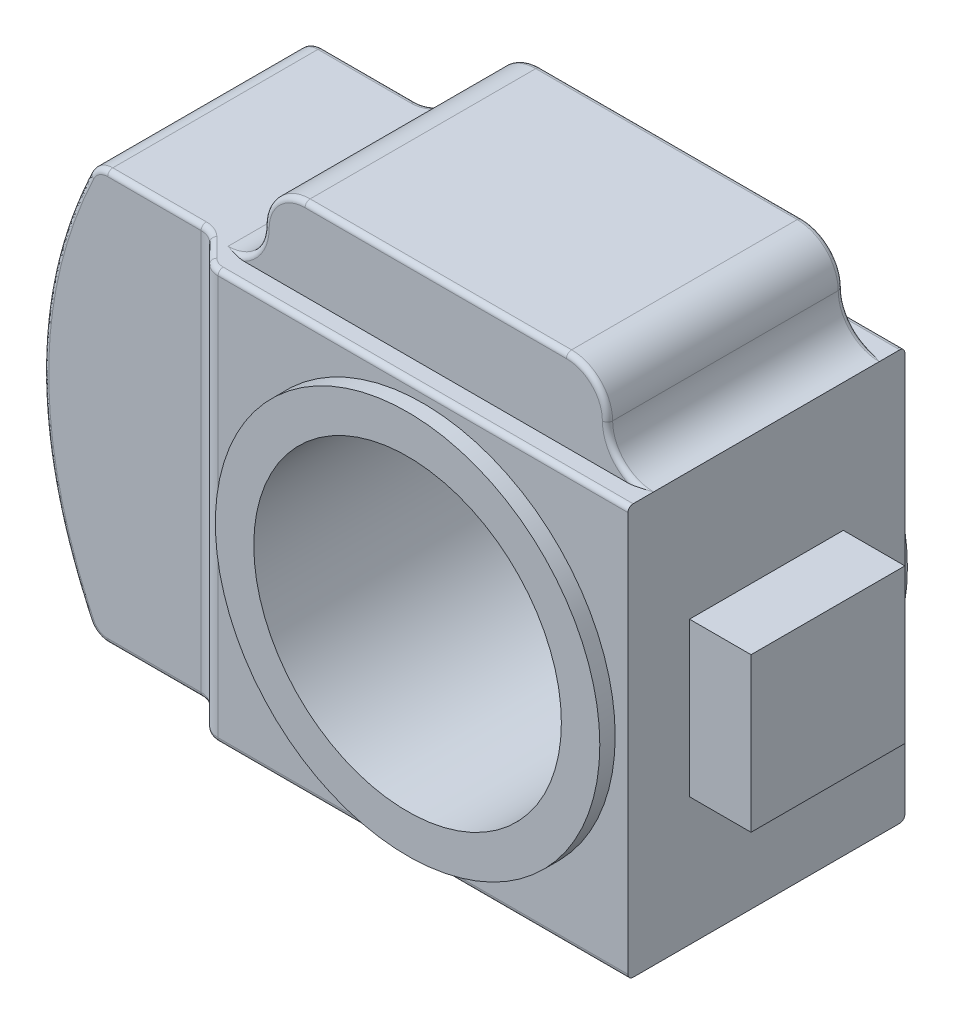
ISO-10303-21;
HEADER;
FILE_DESCRIPTION(('STEP AP214'),'2;1');
FILE_NAME('part.step','',(''),(''),'','','');
FILE_SCHEMA(('AUTOMOTIVE_DESIGN { 1 0 10303 214 1 1 1 1 }'));
ENDSEC;
DATA;
#1=APPLICATION_CONTEXT('core data for automotive mechanical design processes');
#2=APPLICATION_PROTOCOL_DEFINITION('international standard','automotive_design',2000,#1);
#3=PRODUCT_CONTEXT('',#1,'mechanical');
#4=PRODUCT('Part','Part','',(#3));
#5=PRODUCT_RELATED_PRODUCT_CATEGORY('part','',(#4));
#6=PRODUCT_DEFINITION_FORMATION('','',#4);
#7=PRODUCT_DEFINITION_CONTEXT('part definition',#1,'design');
#8=PRODUCT_DEFINITION('design','',#6,#7);
#9=PRODUCT_DEFINITION_SHAPE('','',#8);
#10=(LENGTH_UNIT() NAMED_UNIT(*) SI_UNIT(.MILLI.,.METRE.));
#11=(NAMED_UNIT(*) PLANE_ANGLE_UNIT() SI_UNIT($,.RADIAN.));
#12=(NAMED_UNIT(*) SI_UNIT($,.STERADIAN.) SOLID_ANGLE_UNIT());
#13=UNCERTAINTY_MEASURE_WITH_UNIT(LENGTH_MEASURE(1.E-05),#10,'distance_accuracy_value','');
#14=(GEOMETRIC_REPRESENTATION_CONTEXT(3) GLOBAL_UNCERTAINTY_ASSIGNED_CONTEXT((#13)) GLOBAL_UNIT_ASSIGNED_CONTEXT((#10,
#11,#12)) REPRESENTATION_CONTEXT('',''));
#15=CARTESIAN_POINT('',(0.,0.,0.));
#16=DIRECTION('',(0.,0.,1.));
#17=DIRECTION('',(1.,0.,0.));
#18=AXIS2_PLACEMENT_3D('',#15,#16,#17);
#19=CARTESIAN_POINT('',(60.,40.,60.));
#20=DIRECTION('',(-1.,0.,0.));
#21=DIRECTION('',(0.,0.,1.));
#22=AXIS2_PLACEMENT_3D('',#19,#20,#21);
#23=PLANE('',#22);
#24=DIRECTION('',(0.,0.,-1.));
#25=VECTOR('',#24,1.);
#26=CARTESIAN_POINT('',(60.,-40.,60.));
#27=LINE('',#26,#25);
#28=CARTESIAN_POINT('',(60.,-40.,56.));
#29=VERTEX_POINT('',#28);
#30=CARTESIAN_POINT('',(60.,-40.,4.));
#31=VERTEX_POINT('',#30);
#32=EDGE_CURVE('E965',#29,#31,#27,.T.);
#33=ORIENTED_EDGE('',*,*,#32,.T.);
#34=CARTESIAN_POINT('',(60.,-39.,4.));
#35=DIRECTION('',(-1.,0.,0.));
#36=DIRECTION('',(0.,0.,1.));
#37=AXIS2_PLACEMENT_3D('',#34,#35,#36);
#38=CIRCLE('',#37,1.);
#39=CARTESIAN_POINT('',(60.,-39.,3.));
#40=VERTEX_POINT('',#39);
#41=EDGE_CURVE('E857',#31,#40,#38,.F.);
#42=ORIENTED_EDGE('',*,*,#41,.T.);
#43=DIRECTION('',(0.,1.,0.));
#44=VECTOR('',#43,1.);
#45=CARTESIAN_POINT('',(60.,40.,3.));
#46=LINE('',#45,#44);
#47=CARTESIAN_POINT('',(60.,39.,3.));
#48=VERTEX_POINT('',#47);
#49=EDGE_CURVE('E981',#40,#48,#46,.T.);
#50=ORIENTED_EDGE('',*,*,#49,.T.);
#51=CARTESIAN_POINT('',(60.,39.,4.));
#52=DIRECTION('',(-1.,0.,0.));
#53=DIRECTION('',(0.,0.,1.));
#54=AXIS2_PLACEMENT_3D('',#51,#52,#53);
#55=CIRCLE('',#54,1.);
#56=CARTESIAN_POINT('',(60.,40.,4.));
#57=VERTEX_POINT('',#56);
#58=EDGE_CURVE('E853',#48,#57,#55,.F.);
#59=ORIENTED_EDGE('',*,*,#58,.T.);
#60=DIRECTION('',(0.,0.,-1.));
#61=VECTOR('',#60,1.);
#62=CARTESIAN_POINT('',(60.,40.,60.));
#63=LINE('',#62,#61);
#64=CARTESIAN_POINT('',(60.,40.,8.));
#65=VERTEX_POINT('',#64);
#66=EDGE_CURVE('E83',#65,#57,#63,.T.);
#67=ORIENTED_EDGE('',*,*,#66,.F.);
#68=CARTESIAN_POINT('',(60.,40.,52.));
#69=VERTEX_POINT('',#68);
#70=EDGE_CURVE('E963',#69,#65,#63,.T.);
#71=ORIENTED_EDGE('',*,*,#70,.F.);
#72=CARTESIAN_POINT('',(60.,40.,56.));
#73=VERTEX_POINT('',#72);
#74=EDGE_CURVE('E650',#73,#69,#63,.T.);
#75=ORIENTED_EDGE('',*,*,#74,.F.);
#76=CARTESIAN_POINT('',(60.,39.,56.));
#77=DIRECTION('',(-1.,0.,0.));
#78=DIRECTION('',(0.,0.,1.));
#79=AXIS2_PLACEMENT_3D('',#76,#77,#78);
#80=CIRCLE('',#79,1.);
#81=CARTESIAN_POINT('',(60.,39.,57.));
#82=VERTEX_POINT('',#81);
#83=EDGE_CURVE('E851',#73,#82,#80,.F.);
#84=ORIENTED_EDGE('',*,*,#83,.T.);
#85=DIRECTION('',(0.,1.,0.));
#86=VECTOR('',#85,1.);
#87=CARTESIAN_POINT('',(60.,40.,57.));
#88=LINE('',#87,#86);
#89=CARTESIAN_POINT('',(60.,-39.,57.));
#90=VERTEX_POINT('',#89);
#91=EDGE_CURVE('E975',#90,#82,#88,.T.);
#92=ORIENTED_EDGE('',*,*,#91,.F.);
#93=CARTESIAN_POINT('',(60.,-39.,56.));
#94=DIRECTION('',(-1.,0.,0.));
#95=DIRECTION('',(0.,0.,1.));
#96=AXIS2_PLACEMENT_3D('',#93,#94,#95);
#97=CIRCLE('',#96,1.);
#98=EDGE_CURVE('E855',#90,#29,#97,.F.);
#99=ORIENTED_EDGE('',*,*,#98,.T.);
#100=EDGE_LOOP('',(#33,#42,#50,#59,#67,#71,#75,#84,#92,#99));
#101=FACE_BOUND('',#100,.T.);
#102=DIRECTION('',(0.,1.,0.));
#103=VECTOR('',#102,1.);
#104=CARTESIAN_POINT('',(60.,15.,15.));
#105=LINE('',#104,#103);
#106=CARTESIAN_POINT('',(60.,-15.,15.));
#107=VERTEX_POINT('',#106);
#108=CARTESIAN_POINT('',(60.,15.,15.));
#109=VERTEX_POINT('',#108);
#110=EDGE_CURVE('E367',#107,#109,#105,.T.);
#111=ORIENTED_EDGE('',*,*,#110,.F.);
#112=DIRECTION('',(0.,0.,-1.));
#113=VECTOR('',#112,1.);
#114=CARTESIAN_POINT('',(60.,-15.,45.));
#115=LINE('',#114,#113);
#116=CARTESIAN_POINT('',(60.,-15.,45.));
#117=VERTEX_POINT('',#116);
#118=EDGE_CURVE('E364',#117,#107,#115,.T.);
#119=ORIENTED_EDGE('',*,*,#118,.F.);
#120=DIRECTION('',(0.,-1.,0.));
#121=VECTOR('',#120,1.);
#122=CARTESIAN_POINT('',(60.,15.,45.));
#123=LINE('',#122,#121);
#124=CARTESIAN_POINT('',(60.,15.,45.));
#125=VERTEX_POINT('',#124);
#126=EDGE_CURVE('E1640',#125,#117,#123,.T.);
#127=ORIENTED_EDGE('',*,*,#126,.F.);
#128=DIRECTION('',(0.,0.,1.));
#129=VECTOR('',#128,1.);
#130=CARTESIAN_POINT('',(60.,15.,45.));
#131=LINE('',#130,#129);
#132=EDGE_CURVE('E1053',#109,#125,#131,.T.);
#133=ORIENTED_EDGE('',*,*,#132,.F.);
#134=EDGE_LOOP('',(#111,#119,#127,#133));
#135=FACE_BOUND('',#134,.T.);
#136=ADVANCED_FACE('F64',(#101,#135),#23,.F.);
#137=CARTESIAN_POINT('',(-60.,40.,60.));
#138=DIRECTION('',(0.,-1.,0.));
#139=DIRECTION('',(0.,0.,-1.));
#140=AXIS2_PLACEMENT_3D('',#137,#138,#139);
#141=PLANE('',#140);
#142=CARTESIAN_POINT('',(-29.272556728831,40.,5.));
#143=DIRECTION('',(0.,-1.,0.));
#144=DIRECTION('',(0.,0.,-1.));
#145=AXIS2_PLACEMENT_3D('',#142,#143,#144);
#146=CIRCLE('',#145,5.);
#147=CARTESIAN_POINT('',(-25.7370228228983,40.,8.53553390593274));
#148=VERTEX_POINT('',#147);
#149=CARTESIAN_POINT('',(-29.272556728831,40.,10.));
#150=VERTEX_POINT('',#149);
#151=EDGE_CURVE('E1187',#148,#150,#146,.T.);
#152=ORIENTED_EDGE('',*,*,#151,.T.);
#153=DIRECTION('',(1.,0.,0.));
#154=VECTOR('',#153,1.);
#155=CARTESIAN_POINT('',(-60.,40.,10.));
#156=LINE('',#155,#154);
#157=CARTESIAN_POINT('',(-47.4961594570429,40.,10.));
#158=VERTEX_POINT('',#157);
#159=EDGE_CURVE('E936',#150,#158,#156,.F.);
#160=ORIENTED_EDGE('',*,*,#159,.T.);
#161=DIRECTION('',(0.,0.,-1.));
#162=VECTOR('',#161,1.);
#163=CARTESIAN_POINT('',(-47.4961594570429,40.,57.));
#164=LINE('',#163,#162);
#165=CARTESIAN_POINT('',(-47.4961594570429,40.,50.));
#166=VERTEX_POINT('',#165);
#167=EDGE_CURVE('E899',#158,#166,#164,.F.);
#168=ORIENTED_EDGE('',*,*,#167,.T.);
#169=DIRECTION('',(-1.,0.,0.));
#170=VECTOR('',#169,1.);
#171=CARTESIAN_POINT('',(-60.,40.,50.));
#172=LINE('',#171,#170);
#173=CARTESIAN_POINT('',(-29.272556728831,40.,50.));
#174=VERTEX_POINT('',#173);
#175=EDGE_CURVE('E1180',#166,#174,#172,.F.);
#176=ORIENTED_EDGE('',*,*,#175,.T.);
#177=CARTESIAN_POINT('',(-29.272556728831,40.,55.));
#178=DIRECTION('',(0.,-1.,0.));
#179=DIRECTION('',(0.,0.,-1.));
#180=AXIS2_PLACEMENT_3D('',#177,#178,#179);
#181=CIRCLE('',#180,5.);
#182=CARTESIAN_POINT('',(-25.7370228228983,40.,51.4644660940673));
#183=VERTEX_POINT('',#182);
#184=EDGE_CURVE('E1178',#174,#183,#181,.T.);
#185=ORIENTED_EDGE('',*,*,#184,.T.);
#186=DIRECTION('',(-0.707106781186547,0.,-0.707106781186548));
#187=VECTOR('',#186,1.);
#188=CARTESIAN_POINT('',(-38.6007444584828,40.,38.6007444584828));
#189=LINE('',#188,#187);
#190=CARTESIAN_POINT('',(-22.0801685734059,40.,55.1213203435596));
#191=VERTEX_POINT('',#190);
#192=EDGE_CURVE('E1173',#183,#191,#189,.F.);
#193=ORIENTED_EDGE('',*,*,#192,.T.);
#194=CARTESIAN_POINT('',(-19.9588482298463,40.,53.));
#195=DIRECTION('',(0.,-1.,0.));
#196=DIRECTION('',(0.,0.,-1.));
#197=AXIS2_PLACEMENT_3D('',#194,#195,#196);
#198=CIRCLE('',#197,3.);
#199=CARTESIAN_POINT('',(-19.9588482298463,40.,56.));
#200=VERTEX_POINT('',#199);
#201=EDGE_CURVE('E774',#191,#200,#198,.F.);
#202=ORIENTED_EDGE('',*,*,#201,.T.);
#203=DIRECTION('',(-1.,0.,0.));
#204=VECTOR('',#203,1.);
#205=CARTESIAN_POINT('',(60.,40.,56.));
#206=LINE('',#205,#204);
#207=EDGE_CURVE('E1171',#200,#73,#206,.F.);
#208=ORIENTED_EDGE('',*,*,#207,.T.);
#209=ORIENTED_EDGE('',*,*,#74,.T.);
#210=CARTESIAN_POINT('',(55.8768943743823,40.,53.));
#211=CARTESIAN_POINT('',(55.9619751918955,40.,52.9999820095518));
#212=CARTESIAN_POINT('',(56.0470278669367,40.,52.9977221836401));
#213=CARTESIAN_POINT('',(56.216891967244,40.,52.9892488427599));
#214=CARTESIAN_POINT('',(56.3017035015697,40.,52.9830375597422));
#215=CARTESIAN_POINT('',(56.4707889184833,40.,52.9672095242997));
#216=CARTESIAN_POINT('',(56.5550636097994,40.,52.9576011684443));
#217=CARTESIAN_POINT('',(56.7232263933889,40.,52.9353940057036));
#218=CARTESIAN_POINT('',(56.8071144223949,40.,52.9227947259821));
#219=CARTESIAN_POINT('',(57.0568325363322,40.,52.8812911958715));
#220=CARTESIAN_POINT('',(57.2220275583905,40.,52.8485463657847));
#221=CARTESIAN_POINT('',(57.5507189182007,40.,52.7751309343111));
#222=CARTESIAN_POINT('',(57.7142139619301,40.,52.7344547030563));
#223=CARTESIAN_POINT('',(58.0550536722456,40.,52.6429396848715));
#224=CARTESIAN_POINT('',(58.2322359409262,40.,52.5915021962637));
#225=CARTESIAN_POINT('',(58.5850425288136,40.,52.4835137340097));
#226=CARTESIAN_POINT('',(58.7606666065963,40.,52.4269619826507));
#227=CARTESIAN_POINT('',(59.2863663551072,40.,52.2522326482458));
#228=CARTESIAN_POINT('',(59.6347802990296,40.,52.1291234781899));
#229=CARTESIAN_POINT('',(59.9887563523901,40.,52.0039752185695));
#230=CARTESIAN_POINT('',(59.9943781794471,40.,52.0019876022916));
#231=CARTESIAN_POINT('',(60.,40.,52.));
#232=B_SPLINE_CURVE_WITH_KNOTS('',3,(#210,#211,#212,#213,#214,#215,#216,#217,#218,#219,#220,
#221,#222,#223,#224,#225,#226,#227,#228,#229,#230,#231),.UNSPECIFIED.,.F.,.F.,(4,2,2,2,2,2,2,2,
2,2,4),(0.,0.25517271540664,0.510201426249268,0.764604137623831,1.01904709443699,
1.52398719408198,2.02928702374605,2.58266564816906,3.13612856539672,4.24458178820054,
4.26247033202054),.UNSPECIFIED.);
#233=CARTESIAN_POINT('',(55.8768943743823,40.,53.));
#234=VERTEX_POINT('',#233);
#235=EDGE_CURVE('E12',#69,#234,#232,.F.);
#236=ORIENTED_EDGE('',*,*,#235,.T.);
#237=DIRECTION('',(1.,0.,0.));
#238=VECTOR('',#237,1.);
#239=CARTESIAN_POINT('',(52.,40.,53.));
#240=LINE('',#239,#238);
#241=CARTESIAN_POINT('',(-18.8768943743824,40.,53.));
#242=VERTEX_POINT('',#241);
#243=EDGE_CURVE('E380',#242,#234,#240,.T.);
#244=ORIENTED_EDGE('',*,*,#243,.F.);
#245=CARTESIAN_POINT('',(-18.8768943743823,40.,53.));
#246=CARTESIAN_POINT('',(-18.9619751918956,40.,52.9999820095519));
#247=CARTESIAN_POINT('',(-19.0470278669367,40.,52.9977221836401));
#248=CARTESIAN_POINT('',(-19.216891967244,40.,52.9892488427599));
#249=CARTESIAN_POINT('',(-19.3017035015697,40.,52.9830375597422));
#250=CARTESIAN_POINT('',(-19.4707889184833,40.,52.9672095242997));
#251=CARTESIAN_POINT('',(-19.5550636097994,40.,52.9576011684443));
#252=CARTESIAN_POINT('',(-19.7232263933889,40.,52.9353940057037));
#253=CARTESIAN_POINT('',(-19.807114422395,40.,52.9227947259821));
#254=CARTESIAN_POINT('',(-20.0568325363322,40.,52.8812911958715));
#255=CARTESIAN_POINT('',(-20.2220275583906,40.,52.8485463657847));
#256=CARTESIAN_POINT('',(-20.5507189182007,40.,52.7751309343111));
#257=CARTESIAN_POINT('',(-20.7142139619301,40.,52.7344547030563));
#258=CARTESIAN_POINT('',(-21.0550536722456,40.,52.6429396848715));
#259=CARTESIAN_POINT('',(-21.2322359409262,40.,52.5915021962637));
#260=CARTESIAN_POINT('',(-21.5850425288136,40.,52.4835137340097));
#261=CARTESIAN_POINT('',(-21.7606666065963,40.,52.4269619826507));
#262=CARTESIAN_POINT('',(-22.2863663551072,40.,52.2522326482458));
#263=CARTESIAN_POINT('',(-22.6347802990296,40.,52.12912347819));
#264=CARTESIAN_POINT('',(-22.9887563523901,40.,52.0039752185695));
#265=CARTESIAN_POINT('',(-22.9943781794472,40.,52.0019876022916));
#266=CARTESIAN_POINT('',(-23.,40.,52.));
#267=B_SPLINE_CURVE_WITH_KNOTS('',3,(#245,#246,#247,#248,#249,#250,#251,#252,#253,#254,#255,
#256,#257,#258,#259,#260,#261,#262,#263,#264,#265,#266),.UNSPECIFIED.,.F.,.F.,(4,2,2,2,2,2,2,2,
2,2,4),(0.,0.255172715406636,0.510201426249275,0.764604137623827,1.01904709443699,
1.52398719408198,2.02928702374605,2.58266564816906,3.13612856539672,4.24458178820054,
4.26247033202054),.UNSPECIFIED.);
#268=CARTESIAN_POINT('',(-23.,40.,52.));
#269=VERTEX_POINT('',#268);
#270=EDGE_CURVE('E75',#242,#269,#267,.T.);
#271=ORIENTED_EDGE('',*,*,#270,.T.);
#272=DIRECTION('',(0.,0.,1.));
#273=VECTOR('',#272,1.);
#274=CARTESIAN_POINT('',(-23.,40.,7.00000000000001));
#275=LINE('',#274,#273);
#276=CARTESIAN_POINT('',(-23.,40.,8.00000000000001));
#277=VERTEX_POINT('',#276);
#278=EDGE_CURVE('E814',#269,#277,#275,.F.);
#279=ORIENTED_EDGE('',*,*,#278,.T.);
#280=CARTESIAN_POINT('',(-18.8768943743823,40.,7.00000000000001));
#281=CARTESIAN_POINT('',(-18.9619751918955,40.,7.00001799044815));
#282=CARTESIAN_POINT('',(-19.0470278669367,40.,7.00227781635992));
#283=CARTESIAN_POINT('',(-19.216891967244,40.,7.01075115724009));
#284=CARTESIAN_POINT('',(-19.3017035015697,40.,7.0169624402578));
#285=CARTESIAN_POINT('',(-19.4707889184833,40.,7.03279047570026));
#286=CARTESIAN_POINT('',(-19.5550636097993,40.,7.04239883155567));
#287=CARTESIAN_POINT('',(-19.7232263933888,40.,7.06460599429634));
#288=CARTESIAN_POINT('',(-19.8071144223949,40.,7.07720527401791));
#289=CARTESIAN_POINT('',(-20.0568325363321,40.,7.11870880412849));
#290=CARTESIAN_POINT('',(-20.2220275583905,40.,7.15145363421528));
#291=CARTESIAN_POINT('',(-20.5507189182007,40.,7.22486906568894));
#292=CARTESIAN_POINT('',(-20.7142139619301,40.,7.26554529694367));
#293=CARTESIAN_POINT('',(-21.0550536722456,40.,7.35706031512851));
#294=CARTESIAN_POINT('',(-21.2322359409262,40.,7.40849780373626));
#295=CARTESIAN_POINT('',(-21.5850425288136,40.,7.51648626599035));
#296=CARTESIAN_POINT('',(-21.7606666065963,40.,7.57303801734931));
#297=CARTESIAN_POINT('',(-22.2863663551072,40.,7.74776735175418));
#298=CARTESIAN_POINT('',(-22.6347802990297,40.,7.87087652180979));
#299=CARTESIAN_POINT('',(-22.9887563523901,40.,7.99602478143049));
#300=CARTESIAN_POINT('',(-22.9943781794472,40.,7.99801239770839));
#301=CARTESIAN_POINT('',(-23.,40.,8.00000000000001));
#302=B_SPLINE_CURVE_WITH_KNOTS('',3,(#280,#281,#282,#283,#284,#285,#286,#287,#288,#289,#290,
#291,#292,#293,#294,#295,#296,#297,#298,#299,#300,#301),.UNSPECIFIED.,.F.,.F.,(4,2,2,2,2,2,2,2,
2,2,4),(0.,0.255172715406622,0.510201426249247,0.764604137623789,1.01904709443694,
1.52398719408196,2.02928702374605,2.58266564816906,3.13612856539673,4.24458178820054,
4.26247033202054),.UNSPECIFIED.);
#303=CARTESIAN_POINT('',(-18.8768943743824,40.,7.00000000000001));
#304=VERTEX_POINT('',#303);
#305=EDGE_CURVE('E558',#277,#304,#302,.F.);
#306=ORIENTED_EDGE('',*,*,#305,.T.);
#307=DIRECTION('',(-1.,0.,0.));
#308=VECTOR('',#307,1.);
#309=CARTESIAN_POINT('',(52.,40.,7.));
#310=LINE('',#309,#308);
#311=CARTESIAN_POINT('',(55.8768943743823,40.,7.));
#312=VERTEX_POINT('',#311);
#313=EDGE_CURVE('E377',#312,#304,#310,.T.);
#314=ORIENTED_EDGE('',*,*,#313,.F.);
#315=CARTESIAN_POINT('',(55.8768943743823,40.,7.));
#316=CARTESIAN_POINT('',(55.9619751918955,40.,7.00001799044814));
#317=CARTESIAN_POINT('',(56.0470278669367,40.,7.00227781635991));
#318=CARTESIAN_POINT('',(56.216891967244,40.,7.01075115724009));
#319=CARTESIAN_POINT('',(56.3017035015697,40.,7.0169624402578));
#320=CARTESIAN_POINT('',(56.4707889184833,40.,7.03279047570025));
#321=CARTESIAN_POINT('',(56.5550636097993,40.,7.04239883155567));
#322=CARTESIAN_POINT('',(56.7232263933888,40.,7.06460599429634));
#323=CARTESIAN_POINT('',(56.8071144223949,40.,7.07720527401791));
#324=CARTESIAN_POINT('',(57.0568325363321,40.,7.11870880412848));
#325=CARTESIAN_POINT('',(57.2220275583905,40.,7.15145363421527));
#326=CARTESIAN_POINT('',(57.5507189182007,40.,7.22486906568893));
#327=CARTESIAN_POINT('',(57.7142139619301,40.,7.26554529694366));
#328=CARTESIAN_POINT('',(58.0550536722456,40.,7.3570603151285));
#329=CARTESIAN_POINT('',(58.2322359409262,40.,7.40849780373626));
#330=CARTESIAN_POINT('',(58.5850425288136,40.,7.51648626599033));
#331=CARTESIAN_POINT('',(58.7606666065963,40.,7.57303801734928));
#332=CARTESIAN_POINT('',(59.2863663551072,40.,7.74776735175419));
#333=CARTESIAN_POINT('',(59.6347802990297,40.,7.87087652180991));
#334=CARTESIAN_POINT('',(59.9887563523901,40.,7.99602478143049));
#335=CARTESIAN_POINT('',(59.9943781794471,40.,7.99801239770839));
#336=CARTESIAN_POINT('',(60.,40.,8.));
#337=B_SPLINE_CURVE_WITH_KNOTS('',3,(#315,#316,#317,#318,#319,#320,#321,#322,#323,#324,#325,
#326,#327,#328,#329,#330,#331,#332,#333,#334,#335,#336),.UNSPECIFIED.,.F.,.F.,(4,2,2,2,2,2,2,2,
2,2,4),(0.,0.255172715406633,0.510201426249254,0.764604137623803,1.01904709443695,
1.52398719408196,2.02928702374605,2.58266564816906,3.13612856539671,4.24458178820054,
4.26247033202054),.UNSPECIFIED.);
#338=EDGE_CURVE('E666',#312,#65,#337,.T.);
#339=ORIENTED_EDGE('',*,*,#338,.T.);
#340=ORIENTED_EDGE('',*,*,#66,.T.);
#341=DIRECTION('',(-1.,0.,0.));
#342=VECTOR('',#341,1.);
#343=CARTESIAN_POINT('',(-19.9588482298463,40.,4.));
#344=LINE('',#343,#342);
#345=CARTESIAN_POINT('',(-19.9588482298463,40.,4.));
#346=VERTEX_POINT('',#345);
#347=EDGE_CURVE('E1182',#57,#346,#344,.T.);
#348=ORIENTED_EDGE('',*,*,#347,.T.);
#349=CARTESIAN_POINT('',(-19.9588482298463,40.,7.));
#350=DIRECTION('',(0.,-1.,0.));
#351=DIRECTION('',(0.,0.,-1.));
#352=AXIS2_PLACEMENT_3D('',#349,#350,#351);
#353=CIRCLE('',#352,3.);
#354=CARTESIAN_POINT('',(-22.0801685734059,40.,4.87867965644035));
#355=VERTEX_POINT('',#354);
#356=EDGE_CURVE('E1050',#346,#355,#353,.F.);
#357=ORIENTED_EDGE('',*,*,#356,.T.);
#358=DIRECTION('',(0.707106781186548,0.,-0.707106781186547));
#359=VECTOR('',#358,1.);
#360=CARTESIAN_POINT('',(-68.6007444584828,40.,51.3992555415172));
#361=LINE('',#360,#359);
#362=EDGE_CURVE('E1185',#355,#148,#361,.F.);
#363=ORIENTED_EDGE('',*,*,#362,.T.);
#364=EDGE_LOOP('',(#152,#160,#168,#176,#185,#193,#202,#208,#209,#236,#244,#271,#279,#306,#314,
#339,#340,#348,#357,#363));
#365=FACE_BOUND('',#364,.T.);
#366=ADVANCED_FACE('F493',(#365),#141,.F.);
#367=CARTESIAN_POINT('',(0.,0.,57.));
#368=DIRECTION('',(0.,0.,1.));
#369=DIRECTION('',(1.,0.,0.));
#370=AXIS2_PLACEMENT_3D('',#367,#368,#369);
#371=PLANE('',#370);
#372=DIRECTION('',(0.,1.,0.));
#373=VECTOR('',#372,1.);
#374=CARTESIAN_POINT('',(-19.9588482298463,-40.,57.));
#375=LINE('',#374,#373);
#376=CARTESIAN_POINT('',(-19.9588482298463,39.,57.));
#377=VERTEX_POINT('',#376);
#378=CARTESIAN_POINT('',(-19.9588482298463,-39.,57.));
#379=VERTEX_POINT('',#378);
#380=EDGE_CURVE('E822',#377,#379,#375,.F.);
#381=ORIENTED_EDGE('',*,*,#380,.T.);
#382=DIRECTION('',(1.,0.,0.));
#383=VECTOR('',#382,1.);
#384=CARTESIAN_POINT('',(60.,-39.,57.));
#385=LINE('',#384,#383);
#386=EDGE_CURVE('E926',#379,#90,#385,.T.);
#387=ORIENTED_EDGE('',*,*,#386,.T.);
#388=ORIENTED_EDGE('',*,*,#91,.T.);
#389=DIRECTION('',(-1.,0.,0.));
#390=VECTOR('',#389,1.);
#391=CARTESIAN_POINT('',(-19.9588482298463,39.,57.));
#392=LINE('',#391,#390);
#393=EDGE_CURVE('E928',#82,#377,#392,.T.);
#394=ORIENTED_EDGE('',*,*,#393,.T.);
#395=EDGE_LOOP('',(#381,#387,#388,#394));
#396=FACE_BOUND('',#395,.T.);
#397=CARTESIAN_POINT('',(20.,0.,57.));
#398=DIRECTION('',(0.,0.,1.));
#399=DIRECTION('',(1.,0.,0.));
#400=AXIS2_PLACEMENT_3D('',#397,#398,#399);
#401=CIRCLE('',#400,37.5);
#402=CARTESIAN_POINT('',(57.5,0.,57.));
#403=VERTEX_POINT('',#402);
#404=EDGE_CURVE('E977',#403,#403,#401,.T.);
#405=ORIENTED_EDGE('',*,*,#404,.F.);
#406=EDGE_LOOP('',(#405));
#407=FACE_BOUND('',#406,.T.);
#408=ADVANCED_FACE('F499',(#396,#407),#371,.T.);
#409=CARTESIAN_POINT('',(0.,0.,3.));
#410=DIRECTION('',(0.,0.,-1.));
#411=DIRECTION('',(1.,0.,0.));
#412=AXIS2_PLACEMENT_3D('',#409,#410,#411);
#413=PLANE('',#412);
#414=ORIENTED_EDGE('',*,*,#49,.F.);
#415=DIRECTION('',(1.,0.,0.));
#416=VECTOR('',#415,1.);
#417=CARTESIAN_POINT('',(-19.9588482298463,-39.,3.));
#418=LINE('',#417,#416);
#419=CARTESIAN_POINT('',(-19.9588482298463,-39.,3.));
#420=VERTEX_POINT('',#419);
#421=EDGE_CURVE('E861',#40,#420,#418,.F.);
#422=ORIENTED_EDGE('',*,*,#421,.T.);
#423=DIRECTION('',(0.,1.,0.));
#424=VECTOR('',#423,1.);
#425=CARTESIAN_POINT('',(-19.9588482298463,40.,3.));
#426=LINE('',#425,#424);
#427=CARTESIAN_POINT('',(-19.9588482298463,39.,3.));
#428=VERTEX_POINT('',#427);
#429=EDGE_CURVE('E902',#420,#428,#426,.T.);
#430=ORIENTED_EDGE('',*,*,#429,.T.);
#431=DIRECTION('',(-1.,0.,0.));
#432=VECTOR('',#431,1.);
#433=CARTESIAN_POINT('',(60.,39.,3.));
#434=LINE('',#433,#432);
#435=EDGE_CURVE('E859',#428,#48,#434,.F.);
#436=ORIENTED_EDGE('',*,*,#435,.T.);
#437=EDGE_LOOP('',(#414,#422,#430,#436));
#438=FACE_BOUND('',#437,.T.);
#439=CARTESIAN_POINT('',(20.,0.,3.));
#440=DIRECTION('',(0.,0.,1.));
#441=DIRECTION('',(1.,0.,0.));
#442=AXIS2_PLACEMENT_3D('',#439,#440,#441);
#443=CIRCLE('',#442,37.5);
#444=CARTESIAN_POINT('',(57.5,0.,3.));
#445=VERTEX_POINT('',#444);
#446=EDGE_CURVE('E388',#445,#445,#443,.T.);
#447=ORIENTED_EDGE('',*,*,#446,.T.);
#448=EDGE_LOOP('',(#447));
#449=FACE_BOUND('',#448,.T.);
#450=ADVANCED_FACE('F991',(#438,#449),#413,.T.);
#451=CARTESIAN_POINT('',(-60.,-40.,60.));
#452=DIRECTION('',(0.,1.,0.));
#453=DIRECTION('',(0.,0.,1.));
#454=AXIS2_PLACEMENT_3D('',#451,#452,#453);
#455=PLANE('',#454);
#456=CARTESIAN_POINT('',(-19.9588482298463,-40.,7.));
#457=DIRECTION('',(0.,1.,0.));
#458=DIRECTION('',(0.,0.,1.));
#459=AXIS2_PLACEMENT_3D('',#456,#457,#458);
#460=CIRCLE('',#459,3.);
#461=CARTESIAN_POINT('',(-22.0801685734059,-40.,4.87867965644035));
#462=VERTEX_POINT('',#461);
#463=CARTESIAN_POINT('',(-19.9588482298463,-40.,4.));
#464=VERTEX_POINT('',#463);
#465=EDGE_CURVE('E846',#462,#464,#460,.F.);
#466=ORIENTED_EDGE('',*,*,#465,.T.);
#467=DIRECTION('',(1.,0.,0.));
#468=VECTOR('',#467,1.);
#469=CARTESIAN_POINT('',(60.,-40.,4.));
#470=LINE('',#469,#468);
#471=EDGE_CURVE('E848',#464,#31,#470,.T.);
#472=ORIENTED_EDGE('',*,*,#471,.T.);
#473=ORIENTED_EDGE('',*,*,#32,.F.);
#474=DIRECTION('',(1.,0.,0.));
#475=VECTOR('',#474,1.);
#476=CARTESIAN_POINT('',(-19.9588482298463,-40.,56.));
#477=LINE('',#476,#475);
#478=CARTESIAN_POINT('',(-19.9588482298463,-40.,56.));
#479=VERTEX_POINT('',#478);
#480=EDGE_CURVE('E838',#29,#479,#477,.F.);
#481=ORIENTED_EDGE('',*,*,#480,.T.);
#482=CARTESIAN_POINT('',(-19.9588482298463,-40.,53.));
#483=DIRECTION('',(0.,1.,0.));
#484=DIRECTION('',(0.,0.,1.));
#485=AXIS2_PLACEMENT_3D('',#482,#483,#484);
#486=CIRCLE('',#485,3.);
#487=CARTESIAN_POINT('',(-22.0801685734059,-40.,55.1213203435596));
#488=VERTEX_POINT('',#487);
#489=EDGE_CURVE('E836',#479,#488,#486,.F.);
#490=ORIENTED_EDGE('',*,*,#489,.T.);
#491=DIRECTION('',(0.707106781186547,0.,0.707106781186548));
#492=VECTOR('',#491,1.);
#493=CARTESIAN_POINT('',(-38.6007444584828,-40.,38.6007444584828));
#494=LINE('',#493,#492);
#495=CARTESIAN_POINT('',(-25.7370228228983,-40.,51.4644660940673));
#496=VERTEX_POINT('',#495);
#497=EDGE_CURVE('E834',#488,#496,#494,.F.);
#498=ORIENTED_EDGE('',*,*,#497,.T.);
#499=CARTESIAN_POINT('',(-29.272556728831,-40.,55.));
#500=DIRECTION('',(0.,1.,0.));
#501=DIRECTION('',(0.,0.,1.));
#502=AXIS2_PLACEMENT_3D('',#499,#500,#501);
#503=CIRCLE('',#502,5.);
#504=CARTESIAN_POINT('',(-29.272556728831,-40.,50.));
#505=VERTEX_POINT('',#504);
#506=EDGE_CURVE('E832',#496,#505,#503,.T.);
#507=ORIENTED_EDGE('',*,*,#506,.T.);
#508=DIRECTION('',(1.,0.,0.));
#509=VECTOR('',#508,1.);
#510=CARTESIAN_POINT('',(-60.,-40.,50.));
#511=LINE('',#510,#509);
#512=CARTESIAN_POINT('',(-47.4961594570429,-40.,50.));
#513=VERTEX_POINT('',#512);
#514=EDGE_CURVE('E828',#505,#513,#511,.F.);
#515=ORIENTED_EDGE('',*,*,#514,.T.);
#516=DIRECTION('',(0.,0.,-1.));
#517=VECTOR('',#516,1.);
#518=CARTESIAN_POINT('',(-47.4961594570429,-40.,3.));
#519=LINE('',#518,#517);
#520=CARTESIAN_POINT('',(-47.4961594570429,-40.,10.));
#521=VERTEX_POINT('',#520);
#522=EDGE_CURVE('E892',#513,#521,#519,.T.);
#523=ORIENTED_EDGE('',*,*,#522,.T.);
#524=DIRECTION('',(-1.,0.,0.));
#525=VECTOR('',#524,1.);
#526=CARTESIAN_POINT('',(-60.,-40.,9.99999999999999));
#527=LINE('',#526,#525);
#528=CARTESIAN_POINT('',(-29.272556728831,-40.,10.));
#529=VERTEX_POINT('',#528);
#530=EDGE_CURVE('E840',#521,#529,#527,.F.);
#531=ORIENTED_EDGE('',*,*,#530,.T.);
#532=CARTESIAN_POINT('',(-29.272556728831,-40.,5.));
#533=DIRECTION('',(0.,1.,0.));
#534=DIRECTION('',(0.,0.,1.));
#535=AXIS2_PLACEMENT_3D('',#532,#533,#534);
#536=CIRCLE('',#535,5.);
#537=CARTESIAN_POINT('',(-25.7370228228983,-40.,8.53553390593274));
#538=VERTEX_POINT('',#537);
#539=EDGE_CURVE('E842',#529,#538,#536,.T.);
#540=ORIENTED_EDGE('',*,*,#539,.T.);
#541=DIRECTION('',(-0.707106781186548,0.,0.707106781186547));
#542=VECTOR('',#541,1.);
#543=CARTESIAN_POINT('',(-68.6007444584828,-40.,51.3992555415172));
#544=LINE('',#543,#542);
#545=EDGE_CURVE('E844',#538,#462,#544,.F.);
#546=ORIENTED_EDGE('',*,*,#545,.T.);
#547=EDGE_LOOP('',(#466,#472,#473,#481,#490,#498,#507,#515,#523,#531,#540,#546));
#548=FACE_BOUND('',#547,.T.);
#549=ADVANCED_FACE('F1017',(#548),#455,.F.);
#550=CARTESIAN_POINT('',(0.,0.,0.));
#551=DIRECTION('',(0.,0.,1.));
#552=DIRECTION('',(1.,0.,0.));
#553=AXIS2_PLACEMENT_3D('',#550,#551,#552);
#554=PLANE('',#553);
#555=CARTESIAN_POINT('',(20.,0.,0.));
#556=DIRECTION('',(0.,0.,1.));
#557=DIRECTION('',(1.,0.,0.));
#558=AXIS2_PLACEMENT_3D('',#555,#556,#557);
#559=CIRCLE('',#558,30.);
#560=CARTESIAN_POINT('',(50.,0.,0.));
#561=VERTEX_POINT('',#560);
#562=EDGE_CURVE('E967',#561,#561,#559,.F.);
#563=ORIENTED_EDGE('',*,*,#562,.F.);
#564=EDGE_LOOP('',(#563));
#565=FACE_BOUND('',#564,.T.);
#566=CARTESIAN_POINT('',(20.,0.,0.));
#567=DIRECTION('',(0.,0.,1.));
#568=DIRECTION('',(1.,0.,0.));
#569=AXIS2_PLACEMENT_3D('',#566,#567,#568);
#570=CIRCLE('',#569,37.5);
#571=CARTESIAN_POINT('',(57.5,0.,0.));
#572=VERTEX_POINT('',#571);
#573=EDGE_CURVE('E383',#572,#572,#570,.T.);
#574=ORIENTED_EDGE('',*,*,#573,.F.);
#575=EDGE_LOOP('',(#574));
#576=FACE_BOUND('',#575,.T.);
#577=ADVANCED_FACE('F1014',(#565,#576),#554,.F.);
#578=CARTESIAN_POINT('',(0.,0.,60.));
#579=DIRECTION('',(0.,0.,1.));
#580=DIRECTION('',(1.,0.,0.));
#581=AXIS2_PLACEMENT_3D('',#578,#579,#580);
#582=PLANE('',#581);
#583=CARTESIAN_POINT('',(20.,0.,60.));
#584=DIRECTION('',(0.,0.,1.));
#585=DIRECTION('',(1.,0.,0.));
#586=AXIS2_PLACEMENT_3D('',#583,#584,#585);
#587=CIRCLE('',#586,30.);
#588=CARTESIAN_POINT('',(50.,0.,60.));
#589=VERTEX_POINT('',#588);
#590=EDGE_CURVE('E970',#589,#589,#587,.T.);
#591=ORIENTED_EDGE('',*,*,#590,.F.);
#592=EDGE_LOOP('',(#591));
#593=FACE_BOUND('',#592,.T.);
#594=CARTESIAN_POINT('',(20.,0.,60.));
#595=DIRECTION('',(0.,0.,1.));
#596=DIRECTION('',(1.,0.,0.));
#597=AXIS2_PLACEMENT_3D('',#594,#595,#596);
#598=CIRCLE('',#597,37.5);
#599=CARTESIAN_POINT('',(57.5,0.,60.));
#600=VERTEX_POINT('',#599);
#601=EDGE_CURVE('E978',#600,#600,#598,.T.);
#602=ORIENTED_EDGE('',*,*,#601,.T.);
#603=EDGE_LOOP('',(#602));
#604=FACE_BOUND('',#603,.T.);
#605=ADVANCED_FACE('F1005',(#593,#604),#582,.T.);
#606=CARTESIAN_POINT('',(20.,0.,-0.001000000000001));
#607=DIRECTION('',(0.,0.,1.));
#608=DIRECTION('',(1.,0.,0.));
#609=AXIS2_PLACEMENT_3D('',#606,#607,#608);
#610=CYLINDRICAL_SURFACE('',#609,30.);
#611=ORIENTED_EDGE('',*,*,#590,.T.);
#612=EDGE_LOOP('',(#611));
#613=FACE_BOUND('',#612,.T.);
#614=ORIENTED_EDGE('',*,*,#562,.T.);
#615=EDGE_LOOP('',(#614));
#616=FACE_BOUND('',#615,.T.);
#617=ADVANCED_FACE('F999',(#613,#616),#610,.F.);
#618=CARTESIAN_POINT('',(20.,0.,57.));
#619=DIRECTION('',(0.,0.,1.));
#620=DIRECTION('',(1.,0.,0.));
#621=AXIS2_PLACEMENT_3D('',#618,#619,#620);
#622=CYLINDRICAL_SURFACE('',#621,37.5);
#623=ORIENTED_EDGE('',*,*,#404,.T.);
#624=EDGE_LOOP('',(#623));
#625=FACE_BOUND('',#624,.T.);
#626=ORIENTED_EDGE('',*,*,#601,.F.);
#627=EDGE_LOOP('',(#626));
#628=FACE_BOUND('',#627,.T.);
#629=ADVANCED_FACE('F994',(#625,#628),#622,.T.);
#630=CARTESIAN_POINT('',(20.,0.,3.));
#631=DIRECTION('',(0.,0.,-1.));
#632=DIRECTION('',(-1.,0.,0.));
#633=AXIS2_PLACEMENT_3D('',#630,#631,#632);
#634=CYLINDRICAL_SURFACE('',#633,37.5);
#635=ORIENTED_EDGE('',*,*,#446,.F.);
#636=EDGE_LOOP('',(#635));
#637=FACE_BOUND('',#636,.T.);
#638=ORIENTED_EDGE('',*,*,#573,.T.);
#639=EDGE_LOOP('',(#638));
#640=FACE_BOUND('',#639,.T.);
#641=ADVANCED_FACE('F400',(#637,#640),#634,.T.);
#642=CARTESIAN_POINT('',(-50.,40.,-0.001000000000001));
#643=CARTESIAN_POINT('',(-70.,0.,-0.001000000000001));
#644=CARTESIAN_POINT('',(-50.,-40.,-0.001000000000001));
#645=B_SPLINE_CURVE_WITH_KNOTS('',2,(#642,#643,#644),.UNSPECIFIED.,.F.,.F.,(3,3),(0.,1.),.UNSPECIFIED.);
#646=DIRECTION('',(0.,0.,1.));
#647=VECTOR('',#646,1.);
#648=SURFACE_OF_LINEAR_EXTRUSION('',#645,#647);
#649=DIRECTION('',(0.,0.,1.));
#650=VECTOR('',#649,1.);
#651=CARTESIAN_POINT('',(-51.1144179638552,37.70534611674,57.));
#652=LINE('',#651,#650);
#653=CARTESIAN_POINT('',(-51.1144179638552,37.70534611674,50.));
#654=VERTEX_POINT('',#653);
#655=CARTESIAN_POINT('',(-51.1144179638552,37.70534611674,10.));
#656=VERTEX_POINT('',#655);
#657=EDGE_CURVE('E438',#654,#656,#652,.F.);
#658=ORIENTED_EDGE('',*,*,#657,.T.);
#659=CARTESIAN_POINT('',(-33.4609739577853,-73.0780520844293,10.));
#660=CARTESIAN_POINT('',(-33.4609739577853,-73.0780520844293,9.));
#661=CARTESIAN_POINT('',(-32.5665467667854,-72.6308384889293,9.));
#662=CARTESIAN_POINT('',(-38.9739826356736,-62.0520347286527,10.));
#663=CARTESIAN_POINT('',(-38.9739826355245,-62.0520347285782,9.));
#664=CARTESIAN_POINT('',(-38.0795554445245,-61.6048211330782,9.));
#665=CARTESIAN_POINT('',(-44.4869913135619,-51.0260173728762,10.));
#666=CARTESIAN_POINT('',(-44.4869913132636,-51.026017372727,9.));
#667=CARTESIAN_POINT('',(-43.5925641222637,-50.5788037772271,9.));
#668=CARTESIAN_POINT('',(-49.9999999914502,-40.0000000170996,10.));
#669=CARTESIAN_POINT('',(-49.9999999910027,-40.0000000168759,9.));
#670=CARTESIAN_POINT('',(-49.1055728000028,-39.5527864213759,9.));
#671=CARTESIAN_POINT('',(-50.1900202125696,-39.6199574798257,10.));
#672=CARTESIAN_POINT('',(-50.1900202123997,-39.6199574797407,9.));
#673=CARTESIAN_POINT('',(-49.2938933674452,-39.1761431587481,9.));
#674=CARTESIAN_POINT('',(-50.3778803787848,-39.238822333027,10.));
#675=CARTESIAN_POINT('',(-50.3778803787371,-39.2388223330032,9.));
#676=CARTESIAN_POINT('',(-49.4800587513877,-38.7984460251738,9.));
#677=CARTESIAN_POINT('',(-50.749385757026,-38.4739490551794,10.));
#678=CARTESIAN_POINT('',(-50.7493857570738,-38.4739490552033,9.));
#679=CARTESIAN_POINT('',(-49.8481843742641,-38.0405312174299,9.));
#680=CARTESIAN_POINT('',(-50.933026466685,-38.0902086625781,10.));
#681=CARTESIAN_POINT('',(-50.9330264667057,-38.0902086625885,9.));
#682=CARTESIAN_POINT('',(-50.0301401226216,-37.6603113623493,9.));
#683=CARTESIAN_POINT('',(-52.1679651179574,-35.4700106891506,10.));
#684=CARTESIAN_POINT('',(-52.1679651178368,-35.4700106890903,9.));
#685=CARTESIAN_POINT('',(-51.2536527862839,-35.0643556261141,9.));
#686=CARTESIAN_POINT('',(-53.1456362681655,-33.1968199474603,10.));
#687=CARTESIAN_POINT('',(-53.1456362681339,-33.1968199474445,9.));
#688=CARTESIAN_POINT('',(-52.2218015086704,-32.8132036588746,9.));
#689=CARTESIAN_POINT('',(-54.9282665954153,-28.5798025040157,10.));
#690=CARTESIAN_POINT('',(-54.9282665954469,-28.5798025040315,9.));
#691=CARTESIAN_POINT('',(-53.9863422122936,-28.2430419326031,9.));
#692=CARTESIAN_POINT('',(-55.7331533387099,-26.2359466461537,10.));
#693=CARTESIAN_POINT('',(-55.7331533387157,-26.2359466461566,9.));
#694=CARTESIAN_POINT('',(-54.7826621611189,-25.9240041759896,9.));
#695=CARTESIAN_POINT('',(-56.7954066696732,-22.6748192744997,10.));
#696=CARTESIAN_POINT('',(-56.7954066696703,-22.6748192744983,9.));
#697=CARTESIAN_POINT('',(-55.8332315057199,-22.4020463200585,9.));
#698=CARTESIAN_POINT('',(-57.1254186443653,-21.4797132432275,10.));
#699=CARTESIAN_POINT('',(-57.1254186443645,-21.4797132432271,9.));
#700=CARTESIAN_POINT('',(-56.1595418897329,-21.2203264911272,9.));
#701=CARTESIAN_POINT('',(-57.734639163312,-19.0761926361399,10.));
#702=CARTESIAN_POINT('',(-57.7346391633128,-19.0761926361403,9.));
#703=CARTESIAN_POINT('',(-56.7618261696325,-18.8441711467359,9.));
#704=CARTESIAN_POINT('',(-58.0138527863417,-17.8677794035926,10.));
#705=CARTESIAN_POINT('',(-58.0138527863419,-17.8677794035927,9.));
#706=CARTESIAN_POINT('',(-57.037805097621,-17.649736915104,9.));
#707=CARTESIAN_POINT('',(-58.5193249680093,-15.4396239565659,10.));
#708=CARTESIAN_POINT('',(-58.5193249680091,-15.4396239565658,9.));
#709=CARTESIAN_POINT('',(-57.5373484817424,-15.2500620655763,9.));
#710=CARTESIAN_POINT('',(-58.7455882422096,-14.2198827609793,10.));
#711=CARTESIAN_POINT('',(-58.7455882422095,-14.2198827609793,9.));
#712=CARTESIAN_POINT('',(-57.7609176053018,-14.0448224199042,9.));
#713=CARTESIAN_POINT('',(-59.143368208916,-11.7711529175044,10.));
#714=CARTESIAN_POINT('',(-59.1433682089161,-11.7711529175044,9.));
#715=CARTESIAN_POINT('',(-58.1539158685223,-11.625528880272,9.));
#716=CARTESIAN_POINT('',(-59.3148849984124,-10.542164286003,10.));
#717=CARTESIAN_POINT('',(-59.3148849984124,-10.542164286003,9.));
#718=CARTESIAN_POINT('',(-58.3233451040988,-10.4114750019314,9.));
#719=CARTESIAN_POINT('',(-59.6026166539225,-8.06964730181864,10.));
#720=CARTESIAN_POINT('',(-59.6026166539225,-8.06964730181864,9.));
#721=CARTESIAN_POINT('',(-58.6075519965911,-7.96924707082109,9.));
#722=CARTESIAN_POINT('',(-59.7184776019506,-6.82607610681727,10.));
#723=CARTESIAN_POINT('',(-59.7184776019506,-6.82607610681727,9.));
#724=CARTESIAN_POINT('',(-58.7219799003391,-6.74103222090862,9.));
#725=CARTESIAN_POINT('',(-59.892261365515,-4.33472719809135,10.));
#726=CARTESIAN_POINT('',(-59.8922613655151,-4.33472719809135,9.));
#727=CARTESIAN_POINT('',(-58.8936071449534,-4.28059922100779,9.));
#728=CARTESIAN_POINT('',(-59.9501840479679,-3.08694947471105,10.));
#729=CARTESIAN_POINT('',(-59.9501840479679,-3.08694947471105,9.));
#730=CARTESIAN_POINT('',(-58.9508063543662,-3.04838106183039,9.));
#731=CARTESIAN_POINT('',(-60.0075687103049,-0.589885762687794,10.));
#732=CARTESIAN_POINT('',(-60.0075687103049,-0.589885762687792,9.));
#733=CARTESIAN_POINT('',(-59.0074742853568,-0.582505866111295,9.));
#734=CARTESIAN_POINT('',(-60.0070255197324,0.65940034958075,10.));
#735=CARTESIAN_POINT('',(-60.0070255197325,0.659400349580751,9.));
#736=CARTESIAN_POINT('',(-59.0069379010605,0.651151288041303,9.));
#737=CARTESIAN_POINT('',(-59.9474706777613,3.15651589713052,10.));
#738=CARTESIAN_POINT('',(-59.9474706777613,3.15651589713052,9.));
#739=CARTESIAN_POINT('',(-58.9481268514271,3.11707956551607,9.));
#740=CARTESIAN_POINT('',(-59.8884593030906,4.40434533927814,10.));
#741=CARTESIAN_POINT('',(-59.8884593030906,4.40434533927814,9.));
#742=CARTESIAN_POINT('',(-58.889852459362,4.34935069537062,9.));
#743=CARTESIAN_POINT('',(-59.7125239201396,6.89544973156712,10.));
#744=CARTESIAN_POINT('',(-59.7125239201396,6.89544973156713,9.));
#745=CARTESIAN_POINT('',(-58.7160998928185,6.80954787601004,9.));
#746=CARTESIAN_POINT('',(-59.5956137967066,8.13872570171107,10.));
#747=CARTESIAN_POINT('',(-59.5956137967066,8.13872570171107,9.));
#748=CARTESIAN_POINT('',(-58.600635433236,8.03747489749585,9.));
#749=CARTESIAN_POINT('',(-59.3049222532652,10.6183653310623,10.));
#750=CARTESIAN_POINT('',(-59.3049222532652,10.6183653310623,9.));
#751=CARTESIAN_POINT('',(-58.3135038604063,10.4867472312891,9.));
#752=CARTESIAN_POINT('',(-59.1311398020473,11.8547288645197,10.));
#753=CARTESIAN_POINT('',(-59.1311398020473,11.8547288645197,9.));
#754=CARTESIAN_POINT('',(-58.1418357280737,11.7080924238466,9.));
#755=CARTESIAN_POINT('',(-58.7282321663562,14.3177943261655,10.));
#756=CARTESIAN_POINT('',(-58.7282321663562,14.3177943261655,9.));
#757=CARTESIAN_POINT('',(-57.7437688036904,14.1415653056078,9.));
#758=CARTESIAN_POINT('',(-58.4991180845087,15.5444981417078,10.));
#759=CARTESIAN_POINT('',(-58.4991180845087,15.5444981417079,9.));
#760=CARTESIAN_POINT('',(-57.5173809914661,15.3536947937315,9.));
#761=CARTESIAN_POINT('',(-57.9874284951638,17.9861608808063,10.));
#762=CARTESIAN_POINT('',(-57.9874284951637,17.9861608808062,9.));
#763=CARTESIAN_POINT('',(-57.0116881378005,17.7667422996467,9.));
#764=CARTESIAN_POINT('',(-57.704856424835,19.201120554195,10.));
#765=CARTESIAN_POINT('',(-57.7048564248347,19.2011205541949,9.));
#766=CARTESIAN_POINT('',(-56.7323864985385,18.9676610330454,9.));
#767=CARTESIAN_POINT('',(-57.0163229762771,21.9000015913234,10.));
#768=CARTESIAN_POINT('',(-57.0163229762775,21.9000015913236,9.));
#769=CARTESIAN_POINT('',(-56.0516829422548,21.6358508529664,9.));
#770=CARTESIAN_POINT('',(-56.5969593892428,23.3803890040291,10.));
#771=CARTESIAN_POINT('',(-56.5969593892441,23.3803890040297,9.));
#772=CARTESIAN_POINT('',(-55.6370014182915,23.0997454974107,9.));
#773=CARTESIAN_POINT('',(-55.6847777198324,26.3171373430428,10.));
#774=CARTESIAN_POINT('',(-55.6847777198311,26.3171373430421,9.));
#775=CARTESIAN_POINT('',(-54.7347505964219,26.0045212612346,9.));
#776=CARTESIAN_POINT('',(-55.1919726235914,27.7735024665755,10.));
#777=CARTESIAN_POINT('',(-55.1919726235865,27.773502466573,9.));
#778=CARTESIAN_POINT('',(-54.247194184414,27.4454063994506,9.));
#779=CARTESIAN_POINT('',(-54.1382767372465,30.6586822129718,10.));
#780=CARTESIAN_POINT('',(-54.1382767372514,30.6586822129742,9.));
#781=CARTESIAN_POINT('',(-53.2044142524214,30.3006964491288,9.));
#782=CARTESIAN_POINT('',(-53.5774575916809,32.0875240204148,10.));
#783=CARTESIAN_POINT('',(-53.5774575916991,32.0875240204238,9.));
#784=CARTESIAN_POINT('',(-52.6492619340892,31.7151274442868,9.));
#785=CARTESIAN_POINT('',(-52.3923113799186,34.9175051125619,10.));
#786=CARTESIAN_POINT('',(-52.3923113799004,34.9175051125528,9.));
#787=CARTESIAN_POINT('',(-51.4757412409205,34.5173480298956,9.));
#788=CARTESIAN_POINT('',(-51.7679911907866,36.3186473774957,10.));
#789=CARTESIAN_POINT('',(-51.7679911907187,36.3186473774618,9.));
#790=CARTESIAN_POINT('',(-50.8573797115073,35.9051404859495,9.));
#791=CARTESIAN_POINT('',(-50.9330939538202,38.0900647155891,10.));
#792=CARTESIAN_POINT('',(-50.933093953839,38.0900647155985,9.));
#793=CARTESIAN_POINT('',(-50.0302069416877,37.6601687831,9.));
#794=CARTESIAN_POINT('',(-50.749518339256,38.4736715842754,10.));
#795=CARTESIAN_POINT('',(-50.7495183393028,38.4736715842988,9.));
#796=CARTESIAN_POINT('',(-49.8483157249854,38.0402562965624,9.));
#797=CARTESIAN_POINT('',(-50.3780134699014,39.2385528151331,10.));
#798=CARTESIAN_POINT('',(-50.3780134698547,39.2385528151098,9.));
#799=CARTESIAN_POINT('',(-49.4801906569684,38.7981789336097,9.));
#800=CARTESIAN_POINT('',(-50.1900855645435,39.6198278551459,10.));
#801=CARTESIAN_POINT('',(-50.1900855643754,39.6198278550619,9.));
#802=CARTESIAN_POINT('',(-49.2939581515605,39.1760147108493,9.));
#803=CARTESIAN_POINT('',(-50.0000000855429,39.9999998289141,10.));
#804=CARTESIAN_POINT('',(-50.0000000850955,39.9999998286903,9.));
#805=CARTESIAN_POINT('',(-49.1055728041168,39.552786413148,9.));
#806=CARTESIAN_POINT('',(-44.4869913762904,51.0260172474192,10.));
#807=CARTESIAN_POINT('',(-44.4869913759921,51.02601724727,9.));
#808=CARTESIAN_POINT('',(-43.5925641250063,50.5788037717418,9.));
#809=CARTESIAN_POINT('',(-38.9739826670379,62.0520346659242,10.));
#810=CARTESIAN_POINT('',(-38.9739826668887,62.0520346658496,9.));
#811=CARTESIAN_POINT('',(-38.0795554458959,61.6048211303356,9.));
#812=CARTESIAN_POINT('',(-33.4609739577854,73.0780520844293,10.));
#813=CARTESIAN_POINT('',(-33.4609739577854,73.0780520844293,9.));
#814=CARTESIAN_POINT('',(-32.5665467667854,72.6308384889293,9.));
#815=(BOUNDED_SURFACE() B_SPLINE_SURFACE(3,2,((#659,#660,#661),(#662,#663,#664),(#665,#666,
#667),(#668,#669,#670),(#671,#672,#673),(#674,#675,#676),(#677,#678,#679),(#680,#681,#682),
(#683,#684,#685),(#686,#687,#688),(#689,#690,#691),(#692,#693,#694),(#695,#696,#697),(#698,#699,
#700),(#701,#702,#703),(#704,#705,#706),(#707,#708,#709),(#710,#711,#712),(#713,#714,#715),
(#716,#717,#718),(#719,#720,#721),(#722,#723,#724),(#725,#726,#727),(#728,#729,#730),(#731,#732,
#733),(#734,#735,#736),(#737,#738,#739),(#740,#741,#742),(#743,#744,#745),(#746,#747,#748),
(#749,#750,#751),(#752,#753,#754),(#755,#756,#757),(#758,#759,#760),(#761,#762,#763),(#764,#765,
#766),(#767,#768,#769),(#770,#771,#772),(#773,#774,#775),(#776,#777,#778),(#779,#780,#781),
(#782,#783,#784),(#785,#786,#787),(#788,#789,#790),(#791,#792,#793),(#794,#795,#796),(#797,#798,
#799),(#800,#801,#802),(#803,#804,#805),(#806,#807,#808),(#809,#810,#811),(#812,#813,#814)),
.UNSPECIFIED.,.F.,.F.,.F.) B_SPLINE_SURFACE_WITH_KNOTS((4,3,2,2,2,2,2,2,2,2,2,2,2,2,2,2,2,2,2,2,
2,2,2,3,4),(3,3),(0.,36.9823864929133,38.2456351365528,39.5101743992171,46.8547950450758,
54.2024886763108,57.8793941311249,61.5559317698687,65.2321418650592,68.908345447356,
72.6076264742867,76.3069159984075,80.0065326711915,83.7061318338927,87.404844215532,
91.1036236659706,94.8016615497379,98.4994617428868,103.061863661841,107.623459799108,
112.180291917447,116.736631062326,118.000718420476,119.264418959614,156.246805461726),(0.,1.),
.UNSPECIFIED.) GEOMETRIC_REPRESENTATION_ITEM() RATIONAL_B_SPLINE_SURFACE(((1.,0.707106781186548,
1.),(1.,0.707106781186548,1.),(1.,0.707106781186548,1.),(1.,0.707106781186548,1.),(1.,
0.707106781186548,1.),(1.,0.707106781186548,1.),(1.,0.707106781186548,1.),(1.,0.707106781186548,
1.),(1.,0.707106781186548,1.),(1.,0.707106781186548,1.),(1.,0.707106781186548,1.),(1.,
0.707106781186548,1.),(1.,0.707106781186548,1.),(1.,0.707106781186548,1.),(1.,0.707106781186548,
1.),(1.,0.707106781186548,1.),(1.,0.707106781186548,1.),(1.,0.707106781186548,1.),(1.,
0.707106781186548,1.),(1.,0.707106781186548,1.),(1.,0.707106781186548,1.),(1.,0.707106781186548,
1.),(1.,0.707106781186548,1.),(1.,0.707106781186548,1.),(1.,0.707106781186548,1.),(1.,
0.707106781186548,1.),(1.,0.707106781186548,1.),(1.,0.707106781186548,1.),(1.,0.707106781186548,
1.),(1.,0.707106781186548,1.),(1.,0.707106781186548,1.),(1.,0.707106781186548,1.),(1.,
0.707106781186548,1.),(1.,0.707106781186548,1.),(1.,0.707106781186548,1.),(1.,0.707106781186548,
1.),(1.,0.707106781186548,1.),(1.,0.707106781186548,1.),(1.,0.707106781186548,1.),(1.,
0.707106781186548,1.),(1.,0.707106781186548,1.),(1.,0.707106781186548,1.),(1.,0.707106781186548,
1.),(1.,0.707106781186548,1.),(1.,0.707106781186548,1.),(1.,0.707106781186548,1.),(1.,
0.707106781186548,1.),(1.,0.707106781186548,1.),(1.,0.707106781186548,1.),(1.,0.707106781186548,
1.),(1.,0.707106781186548,1.),(1.,0.707106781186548,1.))) REPRESENTATION_ITEM('') SURFACE());
#816=CARTESIAN_POINT('',(-33.4609739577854,73.0780520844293,10.));
#817=CARTESIAN_POINT('',(-38.9739826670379,62.0520346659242,10.));
#818=CARTESIAN_POINT('',(-44.4869913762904,51.0260172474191,10.));
#819=CARTESIAN_POINT('',(-50.0000000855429,39.9999998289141,10.));
#820=CARTESIAN_POINT('',(-50.1900855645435,39.6198278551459,10.));
#821=CARTESIAN_POINT('',(-50.3780134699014,39.2385528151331,10.));
#822=CARTESIAN_POINT('',(-50.749518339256,38.4736715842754,10.));
#823=CARTESIAN_POINT('',(-50.9330939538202,38.0900647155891,10.));
#824=CARTESIAN_POINT('',(-51.7679911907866,36.3186473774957,10.));
#825=CARTESIAN_POINT('',(-52.3923113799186,34.9175051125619,10.));
#826=CARTESIAN_POINT('',(-53.5774575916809,32.0875240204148,10.));
#827=CARTESIAN_POINT('',(-54.1382767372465,30.6586822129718,10.));
#828=CARTESIAN_POINT('',(-55.1919726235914,27.7735024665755,10.));
#829=CARTESIAN_POINT('',(-55.6847777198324,26.3171373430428,10.));
#830=CARTESIAN_POINT('',(-56.5969593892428,23.3803890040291,10.));
#831=CARTESIAN_POINT('',(-57.0163229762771,21.9000015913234,10.));
#832=CARTESIAN_POINT('',(-57.704856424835,19.201120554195,10.));
#833=CARTESIAN_POINT('',(-57.9874284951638,17.9861608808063,10.));
#834=CARTESIAN_POINT('',(-58.4991180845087,15.5444981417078,10.));
#835=CARTESIAN_POINT('',(-58.7282321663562,14.3177943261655,10.));
#836=CARTESIAN_POINT('',(-59.1311398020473,11.8547288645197,10.));
#837=CARTESIAN_POINT('',(-59.3049222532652,10.6183653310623,10.));
#838=CARTESIAN_POINT('',(-59.5956137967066,8.13872570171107,10.));
#839=CARTESIAN_POINT('',(-59.7125239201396,6.89544973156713,10.));
#840=CARTESIAN_POINT('',(-59.8884593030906,4.40434533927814,10.));
#841=CARTESIAN_POINT('',(-59.9474706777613,3.15651589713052,10.));
#842=CARTESIAN_POINT('',(-60.0070255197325,0.659400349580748,10.));
#843=CARTESIAN_POINT('',(-60.0075687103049,-0.589885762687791,10.));
#844=CARTESIAN_POINT('',(-59.9501840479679,-3.08694947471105,10.));
#845=CARTESIAN_POINT('',(-59.8922613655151,-4.33472719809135,10.));
#846=CARTESIAN_POINT('',(-59.7184776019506,-6.82607610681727,10.));
#847=CARTESIAN_POINT('',(-59.6026166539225,-8.06964730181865,10.));
#848=CARTESIAN_POINT('',(-59.3148849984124,-10.542164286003,10.));
#849=CARTESIAN_POINT('',(-59.143368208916,-11.7711529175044,10.));
#850=CARTESIAN_POINT('',(-58.7455882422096,-14.2198827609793,10.));
#851=CARTESIAN_POINT('',(-58.5193249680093,-15.4396239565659,10.));
#852=CARTESIAN_POINT('',(-58.0138527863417,-17.8677794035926,10.));
#853=CARTESIAN_POINT('',(-57.734639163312,-19.0761926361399,10.));
#854=CARTESIAN_POINT('',(-57.1254186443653,-21.4797132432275,10.));
#855=CARTESIAN_POINT('',(-56.7954066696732,-22.6748192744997,10.));
#856=CARTESIAN_POINT('',(-55.7331533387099,-26.2359466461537,10.));
#857=CARTESIAN_POINT('',(-54.9282665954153,-28.5798025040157,10.));
#858=CARTESIAN_POINT('',(-53.1456362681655,-33.1968199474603,10.));
#859=CARTESIAN_POINT('',(-52.1679651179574,-35.4700106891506,10.));
#860=CARTESIAN_POINT('',(-50.933026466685,-38.0902086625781,10.));
#861=CARTESIAN_POINT('',(-50.749385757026,-38.4739490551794,10.));
#862=CARTESIAN_POINT('',(-50.3778803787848,-39.238822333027,10.));
#863=CARTESIAN_POINT('',(-50.1900202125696,-39.6199574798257,10.));
#864=CARTESIAN_POINT('',(-49.9999999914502,-40.0000000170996,10.));
#865=CARTESIAN_POINT('',(-44.4869913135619,-51.0260173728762,10.));
#866=CARTESIAN_POINT('',(-38.9739826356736,-62.0520347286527,10.));
#867=CARTESIAN_POINT('',(-33.4609739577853,-73.0780520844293,10.));
#868=B_SPLINE_CURVE_WITH_KNOTS('',3,(#816,#817,#818,#819,#820,#821,#822,#823,#824,#825,#826,
#827,#828,#829,#830,#831,#832,#833,#834,#835,#836,#837,#838,#839,#840,#841,#842,#843,#844,#845,
#846,#847,#848,#849,#850,#851,#852,#853,#854,#855,#856,#857,#858,#859,#860,#861,#862,#863,#864,
#865,#866,#867),.UNSPECIFIED.,.F.,.F.,(4,3,2,2,2,2,2,2,2,2,2,2,2,2,2,2,2,2,2,2,2,2,2,3,4),(0.,
36.9823865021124,38.2460870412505,39.5101743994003,44.0665135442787,48.6233456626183,
53.1849417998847,57.7473437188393,61.4451439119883,65.1431817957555,68.8419612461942,
72.5406736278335,76.2402727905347,79.9398894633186,83.6391789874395,87.3384600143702,
91.014663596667,94.6908736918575,98.3674113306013,102.044316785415,109.39201041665,
116.736631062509,118.001170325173,119.264418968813,156.246805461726),.UNSPECIFIED.);
#869=CARTESIAN_POINT('',(-51.1144179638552,-37.70534611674,10.));
#870=VERTEX_POINT('',#869);
#871=EDGE_CURVE('E436',#656,#870,#868,.T.);
#872=ORIENTED_EDGE('',*,*,#871,.T.);
#873=DIRECTION('',(0.,0.,1.));
#874=VECTOR('',#873,1.);
#875=CARTESIAN_POINT('',(-51.1144179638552,-37.70534611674,3.));
#876=LINE('',#875,#874);
#877=CARTESIAN_POINT('',(-51.1144179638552,-37.70534611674,50.));
#878=VERTEX_POINT('',#877);
#879=EDGE_CURVE('E888',#870,#878,#876,.T.);
#880=ORIENTED_EDGE('',*,*,#879,.T.);
#881=CARTESIAN_POINT('',(-33.4609739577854,73.0780520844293,50.));
#882=CARTESIAN_POINT('',(-33.4609739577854,73.0780520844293,51.));
#883=CARTESIAN_POINT('',(-32.5665467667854,72.6308384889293,51.));
#884=CARTESIAN_POINT('',(-38.9739826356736,62.0520347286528,50.));
#885=CARTESIAN_POINT('',(-38.9739826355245,62.0520347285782,51.));
#886=CARTESIAN_POINT('',(-38.0795554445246,61.6048211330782,51.));
#887=CARTESIAN_POINT('',(-44.4869913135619,51.0260173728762,50.));
#888=CARTESIAN_POINT('',(-44.4869913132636,51.0260173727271,51.));
#889=CARTESIAN_POINT('',(-43.5925641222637,50.5788037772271,51.));
#890=CARTESIAN_POINT('',(-49.9999999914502,40.0000000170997,50.));
#891=CARTESIAN_POINT('',(-49.9999999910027,40.0000000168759,51.));
#892=CARTESIAN_POINT('',(-49.1055728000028,39.552786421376,51.));
#893=CARTESIAN_POINT('',(-50.1900202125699,39.6199574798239,50.));
#894=CARTESIAN_POINT('',(-50.1900202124,39.6199574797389,51.));
#895=CARTESIAN_POINT('',(-49.2938933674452,39.1761431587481,51.));
#896=CARTESIAN_POINT('',(-50.377880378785,39.2388223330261,50.));
#897=CARTESIAN_POINT('',(-50.3778803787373,39.2388223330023,51.));
#898=CARTESIAN_POINT('',(-49.4800587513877,38.7984460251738,51.));
#899=CARTESIAN_POINT('',(-50.7493857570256,38.4739490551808,50.));
#900=CARTESIAN_POINT('',(-50.7493857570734,38.4739490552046,51.));
#901=CARTESIAN_POINT('',(-49.8481843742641,38.0405312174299,51.));
#902=CARTESIAN_POINT('',(-50.9330264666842,38.0902086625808,50.));
#903=CARTESIAN_POINT('',(-50.9330264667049,38.0902086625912,51.));
#904=CARTESIAN_POINT('',(-50.0301401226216,37.6603113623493,51.));
#905=CARTESIAN_POINT('',(-52.1679651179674,35.4700106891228,50.));
#906=CARTESIAN_POINT('',(-52.1679651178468,35.4700106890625,51.));
#907=CARTESIAN_POINT('',(-51.2536527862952,35.0643556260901,51.));
#908=CARTESIAN_POINT('',(-53.1456362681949,33.1968199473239,50.));
#909=CARTESIAN_POINT('',(-53.1456362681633,33.1968199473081,51.));
#910=CARTESIAN_POINT('',(-52.2218015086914,32.8132036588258,51.));
#911=CARTESIAN_POINT('',(-54.9282665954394,28.5798025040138,50.));
#912=CARTESIAN_POINT('',(-54.928266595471,28.5798025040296,51.));
#913=CARTESIAN_POINT('',(-53.9863422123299,28.2430419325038,51.));
#914=CARTESIAN_POINT('',(-55.7331533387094,26.2359466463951,50.));
#915=CARTESIAN_POINT('',(-55.7331533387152,26.235946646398,51.));
#916=CARTESIAN_POINT('',(-54.7826621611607,25.9240041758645,51.));
#917=CARTESIAN_POINT('',(-56.7954066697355,22.6748192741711,50.));
#918=CARTESIAN_POINT('',(-56.7954066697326,22.6748192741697,51.));
#919=CARTESIAN_POINT('',(-55.8332315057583,22.4020463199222,51.));
#920=CARTESIAN_POINT('',(-57.125418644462,21.4797132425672,50.));
#921=CARTESIAN_POINT('',(-57.1254186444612,21.4797132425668,51.));
#922=CARTESIAN_POINT('',(-56.1595418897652,21.220326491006,51.));
#923=CARTESIAN_POINT('',(-57.7346391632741,19.0761926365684,50.));
#924=CARTESIAN_POINT('',(-57.7346391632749,19.0761926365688,51.));
#925=CARTESIAN_POINT('',(-56.7618261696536,18.8441711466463,51.));
#926=CARTESIAN_POINT('',(-58.0138527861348,17.8677794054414,50.));
#927=CARTESIAN_POINT('',(-58.013852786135,17.8677794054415,51.));
#928=CARTESIAN_POINT('',(-57.037805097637,17.6497369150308,51.));
#929=CARTESIAN_POINT('',(-58.5193249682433,15.4396239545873,50.));
#930=CARTESIAN_POINT('',(-58.5193249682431,15.4396239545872,51.));
#931=CARTESIAN_POINT('',(-57.5373484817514,15.2500620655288,51.));
#932=CARTESIAN_POINT('',(-58.7455882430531,14.2198827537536,50.));
#933=CARTESIAN_POINT('',(-58.7455882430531,14.2198827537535,51.));
#934=CARTESIAN_POINT('',(-57.7609176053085,14.0448224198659,51.));
#935=CARTESIAN_POINT('',(-59.143368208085,11.7711529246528,50.));
#936=CARTESIAN_POINT('',(-59.1433682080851,11.7711529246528,51.));
#937=CARTESIAN_POINT('',(-58.153915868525,11.6255288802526,51.));
#938=CARTESIAN_POINT('',(-59.3148849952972,10.5421643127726,50.));
#939=CARTESIAN_POINT('',(-59.3148849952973,10.5421643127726,51.));
#940=CARTESIAN_POINT('',(-58.3233451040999,10.4114750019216,51.));
#941=CARTESIAN_POINT('',(-59.6026166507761,8.06964732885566,50.));
#942=CARTESIAN_POINT('',(-59.6026166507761,8.06964732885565,51.));
#943=CARTESIAN_POINT('',(-58.6075519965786,7.96924707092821,51.));
#944=CARTESIAN_POINT('',(-59.7184776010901,6.82607611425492,50.));
#945=CARTESIAN_POINT('',(-59.7184776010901,6.82607611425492,51.));
#946=CARTESIAN_POINT('',(-58.721979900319,6.74103222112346,51.));
#947=CARTESIAN_POINT('',(-59.8922613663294,4.33472719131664,50.));
#948=CARTESIAN_POINT('',(-59.8922613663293,4.33472719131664,51.));
#949=CARTESIAN_POINT('',(-58.8936071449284,4.28059922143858,51.));
#950=CARTESIAN_POINT('',(-59.950184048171,3.08694947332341,50.));
#951=CARTESIAN_POINT('',(-59.950184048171,3.08694947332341,51.));
#952=CARTESIAN_POINT('',(-58.9508063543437,3.04838106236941,51.));
#953=CARTESIAN_POINT('',(-60.0075687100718,0.589885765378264,50.));
#954=CARTESIAN_POINT('',(-60.0075687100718,0.589885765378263,51.));
#955=CARTESIAN_POINT('',(-59.0074742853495,0.582505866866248,51.));
#956=CARTESIAN_POINT('',(-60.0070255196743,-0.659400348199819,50.));
#957=CARTESIAN_POINT('',(-60.0070255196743,-0.659400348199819,51.));
#958=CARTESIAN_POINT('',(-59.0069379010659,-0.651151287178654,51.));
#959=CARTESIAN_POINT('',(-59.9474706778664,-3.15651589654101,50.));
#960=CARTESIAN_POINT('',(-59.9474706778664,-3.15651589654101,51.));
#961=CARTESIAN_POINT('',(-58.9481268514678,-3.1170795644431,51.));
#962=CARTESIAN_POINT('',(-59.888459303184,-4.4043453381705,50.));
#963=CARTESIAN_POINT('',(-59.888459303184,-4.4043453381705,51.));
#964=CARTESIAN_POINT('',(-58.8898524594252,-4.34935069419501,51.));
#965=CARTESIAN_POINT('',(-59.7125239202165,-6.8954497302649,50.));
#966=CARTESIAN_POINT('',(-59.7125239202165,-6.8954497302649,51.));
#967=CARTESIAN_POINT('',(-58.7160998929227,-6.8095478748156,51.));
#968=CARTESIAN_POINT('',(-59.5956137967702,-8.13872570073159,50.));
#969=CARTESIAN_POINT('',(-59.5956137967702,-8.13872570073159,51.));
#970=CARTESIAN_POINT('',(-58.6006354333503,-8.0374748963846,51.));
#971=CARTESIAN_POINT('',(-59.3049222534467,-10.6183653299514,50.));
#972=CARTESIAN_POINT('',(-59.3049222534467,-10.6183653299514,51.));
#973=CARTESIAN_POINT('',(-58.313503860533,-10.4867472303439,51.));
#974=CARTESIAN_POINT('',(-59.1311398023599,-11.8547288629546,50.));
#975=CARTESIAN_POINT('',(-59.1311398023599,-11.8547288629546,51.));
#976=CARTESIAN_POINT('',(-58.1418357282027,-11.7080924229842,51.));
#977=CARTESIAN_POINT('',(-58.7282321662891,-14.31779432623,50.));
#978=CARTESIAN_POINT('',(-58.7282321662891,-14.31779432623,51.));
#979=CARTESIAN_POINT('',(-57.7437688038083,-14.1415653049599,51.));
#980=CARTESIAN_POINT('',(-58.4991180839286,-15.5444981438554,50.));
#981=CARTESIAN_POINT('',(-58.4991180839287,-15.5444981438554,51.));
#982=CARTESIAN_POINT('',(-57.5173809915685,-15.3536947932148,51.));
#983=CARTESIAN_POINT('',(-57.9874284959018,-17.9861608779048,50.));
#984=CARTESIAN_POINT('',(-57.9874284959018,-17.9861608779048,51.));
#985=CARTESIAN_POINT('',(-57.0116881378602,-17.7667422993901,51.));
#986=CARTESIAN_POINT('',(-57.7048564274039,-19.2011205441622,50.));
#987=CARTESIAN_POINT('',(-57.7048564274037,-19.2011205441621,51.));
#988=CARTESIAN_POINT('',(-56.732386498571,-18.9676610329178,51.));
#989=CARTESIAN_POINT('',(-57.0163229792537,-21.9000015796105,50.));
#990=CARTESIAN_POINT('',(-57.016322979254,-21.9000015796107,51.));
#991=CARTESIAN_POINT('',(-56.0516829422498,-21.6358508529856,51.));
#992=CARTESIAN_POINT('',(-56.5969593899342,-23.3803890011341,50.));
#993=CARTESIAN_POINT('',(-56.5969593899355,-23.3803890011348,51.));
#994=CARTESIAN_POINT('',(-55.6370014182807,-23.099745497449,51.));
#995=CARTESIAN_POINT('',(-55.6847777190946,-26.3171373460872,50.));
#996=CARTESIAN_POINT('',(-55.6847777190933,-26.3171373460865,51.));
#997=CARTESIAN_POINT('',(-54.7347505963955,-26.0045212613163,51.));
#998=CARTESIAN_POINT('',(-55.1919726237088,-27.7735024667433,50.));
#999=CARTESIAN_POINT('',(-55.1919726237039,-27.7735024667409,51.));
#1000=CARTESIAN_POINT('',(-54.2471941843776,-27.4454063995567,51.));
#1001=CARTESIAN_POINT('',(-54.1382767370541,-30.6586822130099,50.));
#1002=CARTESIAN_POINT('',(-54.138276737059,-30.6586822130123,51.));
#1003=CARTESIAN_POINT('',(-53.204414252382,-30.3006964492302,51.));
#1004=CARTESIAN_POINT('',(-53.577457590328,-32.0875240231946,50.));
#1005=CARTESIAN_POINT('',(-53.5774575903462,-32.0875240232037,51.));
#1006=CARTESIAN_POINT('',(-52.6492619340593,-31.7151274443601,51.));
#1007=CARTESIAN_POINT('',(-52.3923113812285,-34.9175051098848,50.));
#1008=CARTESIAN_POINT('',(-52.3923113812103,-34.9175051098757,51.));
#1009=CARTESIAN_POINT('',(-51.475741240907,-34.5173480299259,51.));
#1010=CARTESIAN_POINT('',(-51.7679911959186,-36.3186473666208,50.));
#1011=CARTESIAN_POINT('',(-51.7679911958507,-36.3186473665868,51.));
#1012=CARTESIAN_POINT('',(-50.8573797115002,-35.9051404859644,51.));
#1013=CARTESIAN_POINT('',(-50.9330939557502,-38.0900647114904,50.));
#1014=CARTESIAN_POINT('',(-50.933093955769,-38.0900647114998,51.));
#1015=CARTESIAN_POINT('',(-50.0302069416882,-37.6601687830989,51.));
#1016=CARTESIAN_POINT('',(-50.7495183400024,-38.4736715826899,50.));
#1017=CARTESIAN_POINT('',(-50.7495183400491,-38.4736715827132,51.));
#1018=CARTESIAN_POINT('',(-49.8483157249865,-38.0402562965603,51.));
#1019=CARTESIAN_POINT('',(-50.3780134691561,-39.2385528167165,50.));
#1020=CARTESIAN_POINT('',(-50.3780134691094,-39.2385528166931,51.));
#1021=CARTESIAN_POINT('',(-49.4801906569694,-38.7981789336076,51.));
#1022=CARTESIAN_POINT('',(-50.1900855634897,-39.6198278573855,50.));
#1023=CARTESIAN_POINT('',(-50.1900855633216,-39.6198278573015,51.));
#1024=CARTESIAN_POINT('',(-49.2939581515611,-39.1760147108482,51.));
#1025=CARTESIAN_POINT('',(-50.0000000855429,-39.9999998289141,50.));
#1026=CARTESIAN_POINT('',(-50.0000000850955,-39.9999998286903,51.));
#1027=CARTESIAN_POINT('',(-49.1055728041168,-39.5527864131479,51.));
#1028=CARTESIAN_POINT('',(-44.4869913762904,-51.0260172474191,50.));
#1029=CARTESIAN_POINT('',(-44.4869913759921,-51.02601724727,51.));
#1030=CARTESIAN_POINT('',(-43.5925641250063,-50.5788037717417,51.));
#1031=CARTESIAN_POINT('',(-38.9739826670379,-62.0520346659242,50.));
#1032=CARTESIAN_POINT('',(-38.9739826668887,-62.0520346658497,51.));
#1033=CARTESIAN_POINT('',(-38.0795554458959,-61.6048211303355,51.));
#1034=CARTESIAN_POINT('',(-33.4609739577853,-73.0780520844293,50.));
#1035=CARTESIAN_POINT('',(-33.4609739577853,-73.0780520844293,51.));
#1036=CARTESIAN_POINT('',(-32.5665467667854,-72.6308384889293,51.));
#1037=(BOUNDED_SURFACE() B_SPLINE_SURFACE(3,2,((#881,#882,#883),(#884,#885,#886),(#887,#888,
#889),(#890,#891,#892),(#893,#894,#895),(#896,#897,#898),(#899,#900,#901),(#902,#903,#904),
(#905,#906,#907),(#908,#909,#910),(#911,#912,#913),(#914,#915,#916),(#917,#918,#919),(#920,#921,
#922),(#923,#924,#925),(#926,#927,#928),(#929,#930,#931),(#932,#933,#934),(#935,#936,#937),
(#938,#939,#940),(#941,#942,#943),(#944,#945,#946),(#947,#948,#949),(#950,#951,#952),(#953,#954,
#955),(#956,#957,#958),(#959,#960,#961),(#962,#963,#964),(#965,#966,#967),(#968,#969,#970),
(#971,#972,#973),(#974,#975,#976),(#977,#978,#979),(#980,#981,#982),(#983,#984,#985),(#986,#987,
#988),(#989,#990,#991),(#992,#993,#994),(#995,#996,#997),(#998,#999,#1000),(#1001,#1002,#1003),
(#1004,#1005,#1006),(#1007,#1008,#1009),(#1010,#1011,#1012),(#1013,#1014,#1015),(#1016,#1017,
#1018),(#1019,#1020,#1021),(#1022,#1023,#1024),(#1025,#1026,#1027),(#1028,#1029,#1030),(#1031,
#1032,#1033),(#1034,#1035,#1036)),.UNSPECIFIED.,.F.,.F.,.F.) B_SPLINE_SURFACE_WITH_KNOTS((4,3,2,
2,2,2,2,2,2,2,2,2,2,2,2,2,2,2,2,2,2,2,2,3,4),(3,3),(0.,36.9823864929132,38.2456351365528,
39.5101743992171,46.8547950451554,54.2024886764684,57.8793941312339,61.5559317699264,
65.2321418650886,68.9083454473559,72.6076264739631,76.3069159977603,80.0065326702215,
83.7061318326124,87.404844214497,91.1036236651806,94.8016615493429,98.4994617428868,
103.061863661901,107.623459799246,112.180291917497,116.736631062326,118.000718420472,
119.264418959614,156.246805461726),(0.,1.),
.UNSPECIFIED.) GEOMETRIC_REPRESENTATION_ITEM() RATIONAL_B_SPLINE_SURFACE(((1.,0.707106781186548,
1.),(1.,0.707106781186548,1.),(1.,0.707106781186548,1.),(1.,0.707106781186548,1.),(1.,
0.707106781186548,1.),(1.,0.707106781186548,1.),(1.,0.707106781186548,1.),(1.,0.707106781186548,
1.),(1.,0.707106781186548,1.),(1.,0.707106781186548,1.),(1.,0.707106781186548,1.),(1.,
0.707106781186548,1.),(1.,0.707106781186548,1.),(1.,0.707106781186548,1.),(1.,0.707106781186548,
1.),(1.,0.707106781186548,1.),(1.,0.707106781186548,1.),(1.,0.707106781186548,1.),(1.,
0.707106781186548,1.),(1.,0.707106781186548,1.),(1.,0.707106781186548,1.),(1.,0.707106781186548,
1.),(1.,0.707106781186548,1.),(1.,0.707106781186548,1.),(1.,0.707106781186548,1.),(1.,
0.707106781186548,1.),(1.,0.707106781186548,1.),(1.,0.707106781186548,1.),(1.,0.707106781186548,
1.),(1.,0.707106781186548,1.),(1.,0.707106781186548,1.),(1.,0.707106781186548,1.),(1.,
0.707106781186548,1.),(1.,0.707106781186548,1.),(1.,0.707106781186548,1.),(1.,0.707106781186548,
1.),(1.,0.707106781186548,1.),(1.,0.707106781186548,1.),(1.,0.707106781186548,1.),(1.,
0.707106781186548,1.),(1.,0.707106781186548,1.),(1.,0.707106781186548,1.),(1.,0.707106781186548,
1.),(1.,0.707106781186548,1.),(1.,0.707106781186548,1.),(1.,0.707106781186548,1.),(1.,
0.707106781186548,1.),(1.,0.707106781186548,1.),(1.,0.707106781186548,1.),(1.,0.707106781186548,
1.),(1.,0.707106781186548,1.),(1.,0.707106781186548,1.))) REPRESENTATION_ITEM('') SURFACE());
#1038=CARTESIAN_POINT('',(-33.4609739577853,-73.0780520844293,50.));
#1039=CARTESIAN_POINT('',(-38.9739826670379,-62.0520346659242,50.));
#1040=CARTESIAN_POINT('',(-44.4869913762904,-51.0260172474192,50.));
#1041=CARTESIAN_POINT('',(-50.0000000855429,-39.9999998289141,50.));
#1042=CARTESIAN_POINT('',(-50.1900855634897,-39.6198278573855,50.));
#1043=CARTESIAN_POINT('',(-50.3780134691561,-39.2385528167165,50.));
#1044=CARTESIAN_POINT('',(-50.7495183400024,-38.4736715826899,50.));
#1045=CARTESIAN_POINT('',(-50.9330939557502,-38.0900647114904,50.));
#1046=CARTESIAN_POINT('',(-51.7679911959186,-36.3186473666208,50.));
#1047=CARTESIAN_POINT('',(-52.3923113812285,-34.9175051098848,50.));
#1048=CARTESIAN_POINT('',(-53.577457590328,-32.0875240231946,50.));
#1049=CARTESIAN_POINT('',(-54.1382767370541,-30.6586822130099,50.));
#1050=CARTESIAN_POINT('',(-55.1919726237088,-27.7735024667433,50.));
#1051=CARTESIAN_POINT('',(-55.6847777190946,-26.3171373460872,50.));
#1052=CARTESIAN_POINT('',(-56.5969593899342,-23.3803890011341,50.));
#1053=CARTESIAN_POINT('',(-57.0163229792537,-21.9000015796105,50.));
#1054=CARTESIAN_POINT('',(-57.7048564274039,-19.2011205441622,50.));
#1055=CARTESIAN_POINT('',(-57.9874284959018,-17.9861608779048,50.));
#1056=CARTESIAN_POINT('',(-58.4991180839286,-15.5444981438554,50.));
#1057=CARTESIAN_POINT('',(-58.7282321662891,-14.31779432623,50.));
#1058=CARTESIAN_POINT('',(-59.1311398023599,-11.8547288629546,50.));
#1059=CARTESIAN_POINT('',(-59.3049222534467,-10.6183653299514,50.));
#1060=CARTESIAN_POINT('',(-59.5956137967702,-8.13872570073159,50.));
#1061=CARTESIAN_POINT('',(-59.7125239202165,-6.8954497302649,50.));
#1062=CARTESIAN_POINT('',(-59.888459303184,-4.4043453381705,50.));
#1063=CARTESIAN_POINT('',(-59.9474706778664,-3.156515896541,50.));
#1064=CARTESIAN_POINT('',(-60.0070255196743,-0.659400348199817,50.));
#1065=CARTESIAN_POINT('',(-60.0075687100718,0.58988576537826,50.));
#1066=CARTESIAN_POINT('',(-59.950184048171,3.0869494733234,50.));
#1067=CARTESIAN_POINT('',(-59.8922613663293,4.33472719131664,50.));
#1068=CARTESIAN_POINT('',(-59.7184776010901,6.82607611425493,50.));
#1069=CARTESIAN_POINT('',(-59.6026166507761,8.06964732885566,50.));
#1070=CARTESIAN_POINT('',(-59.3148849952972,10.5421643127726,50.));
#1071=CARTESIAN_POINT('',(-59.143368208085,11.7711529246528,50.));
#1072=CARTESIAN_POINT('',(-58.7455882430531,14.2198827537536,50.));
#1073=CARTESIAN_POINT('',(-58.5193249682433,15.4396239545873,50.));
#1074=CARTESIAN_POINT('',(-58.0138527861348,17.8677794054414,50.));
#1075=CARTESIAN_POINT('',(-57.7346391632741,19.0761926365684,50.));
#1076=CARTESIAN_POINT('',(-57.125418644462,21.4797132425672,50.));
#1077=CARTESIAN_POINT('',(-56.7954066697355,22.6748192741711,50.));
#1078=CARTESIAN_POINT('',(-55.7331533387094,26.2359466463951,50.));
#1079=CARTESIAN_POINT('',(-54.9282665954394,28.5798025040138,50.));
#1080=CARTESIAN_POINT('',(-53.1456362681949,33.1968199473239,50.));
#1081=CARTESIAN_POINT('',(-52.1679651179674,35.4700106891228,50.));
#1082=CARTESIAN_POINT('',(-50.9330264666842,38.0902086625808,50.));
#1083=CARTESIAN_POINT('',(-50.7493857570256,38.4739490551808,50.));
#1084=CARTESIAN_POINT('',(-50.377880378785,39.2388223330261,50.));
#1085=CARTESIAN_POINT('',(-50.19002021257,39.6199574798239,50.));
#1086=CARTESIAN_POINT('',(-49.9999999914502,40.0000000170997,50.));
#1087=CARTESIAN_POINT('',(-44.4869913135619,51.0260173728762,50.));
#1088=CARTESIAN_POINT('',(-38.9739826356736,62.0520347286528,50.));
#1089=CARTESIAN_POINT('',(-33.4609739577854,73.0780520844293,50.));
#1090=B_SPLINE_CURVE_WITH_KNOTS('',3,(#1038,#1039,#1040,#1041,#1042,#1043,#1044,#1045,#1046,
#1047,#1048,#1049,#1050,#1051,#1052,#1053,#1054,#1055,#1056,#1057,#1058,#1059,#1060,#1061,#1062,
#1063,#1064,#1065,#1066,#1067,#1068,#1069,#1070,#1071,#1072,#1073,#1074,#1075,#1076,#1077,#1078,
#1079,#1080,#1081,#1082,#1083,#1084,#1085,#1086,#1087,#1088,#1089),.UNSPECIFIED.,.F.,.F.,(4,3,2,
2,2,2,2,2,2,2,2,2,2,2,2,2,2,2,2,2,2,2,2,3,4),(0.,36.9823865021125,38.2460870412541,
39.5101743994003,44.0665135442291,48.62334566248,53.1849417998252,57.7473437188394,
61.4451439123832,65.1431817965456,68.8419612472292,72.5406736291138,76.2402727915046,
79.9398894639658,83.639178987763,87.3384600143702,91.0146635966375,94.6908736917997,
98.3674113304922,102.044316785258,109.392010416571,116.736631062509,118.001170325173,
119.264418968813,156.246805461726),.UNSPECIFIED.);
#1091=EDGE_CURVE('E430',#878,#654,#1090,.T.);
#1092=ORIENTED_EDGE('',*,*,#1091,.T.);
#1093=EDGE_LOOP('',(#658,#872,#880,#1092));
#1094=FACE_BOUND('',#1093,.T.);
#1095=ADVANCED_FACE('F394',(#1094),#648,.T.);
#1096=CARTESIAN_POINT('',(-47.4961594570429,-36.,30.));
#1097=DIRECTION('',(0.,0.,1.));
#1098=DIRECTION('',(1.,0.,0.));
#1099=AXIS2_PLACEMENT_3D('',#1096,#1097,#1098);
#1100=CYLINDRICAL_SURFACE('',#1099,4.);
#1101=ORIENTED_EDGE('',*,*,#879,.F.);
#1102=CARTESIAN_POINT('',(-47.4961594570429,-36.,10.));
#1103=DIRECTION('',(0.,0.,1.));
#1104=DIRECTION('',(1.,0.,0.));
#1105=AXIS2_PLACEMENT_3D('',#1102,#1103,#1104);
#1106=CIRCLE('',#1105,4.);
#1107=EDGE_CURVE('E437',#870,#521,#1106,.T.);
#1108=ORIENTED_EDGE('',*,*,#1107,.T.);
#1109=ORIENTED_EDGE('',*,*,#522,.F.);
#1110=CARTESIAN_POINT('',(-47.4961594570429,-36.,50.));
#1111=DIRECTION('',(0.,0.,-1.));
#1112=DIRECTION('',(-1.,0.,0.));
#1113=AXIS2_PLACEMENT_3D('',#1110,#1111,#1112);
#1114=CIRCLE('',#1113,4.);
#1115=EDGE_CURVE('E726',#513,#878,#1114,.T.);
#1116=ORIENTED_EDGE('',*,*,#1115,.T.);
#1117=EDGE_LOOP('',(#1101,#1108,#1109,#1116));
#1118=FACE_BOUND('',#1117,.T.);
#1119=ADVANCED_FACE('F399',(#1118),#1100,.T.);
#1120=CARTESIAN_POINT('',(-47.4961594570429,36.,30.));
#1121=DIRECTION('',(0.,0.,1.));
#1122=DIRECTION('',(1.,0.,0.));
#1123=AXIS2_PLACEMENT_3D('',#1120,#1121,#1122);
#1124=CYLINDRICAL_SURFACE('',#1123,4.);
#1125=ORIENTED_EDGE('',*,*,#167,.F.);
#1126=CARTESIAN_POINT('',(-47.4961594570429,36.,10.));
#1127=DIRECTION('',(0.,0.,1.));
#1128=DIRECTION('',(1.,0.,0.));
#1129=AXIS2_PLACEMENT_3D('',#1126,#1127,#1128);
#1130=CIRCLE('',#1129,4.);
#1131=EDGE_CURVE('E962',#158,#656,#1130,.T.);
#1132=ORIENTED_EDGE('',*,*,#1131,.T.);
#1133=ORIENTED_EDGE('',*,*,#657,.F.);
#1134=CARTESIAN_POINT('',(-47.4961594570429,36.,50.));
#1135=DIRECTION('',(0.,0.,-1.));
#1136=DIRECTION('',(-1.,0.,0.));
#1137=AXIS2_PLACEMENT_3D('',#1134,#1135,#1136);
#1138=CIRCLE('',#1137,4.);
#1139=EDGE_CURVE('E955',#654,#166,#1138,.T.);
#1140=ORIENTED_EDGE('',*,*,#1139,.T.);
#1141=EDGE_LOOP('',(#1125,#1132,#1133,#1140));
#1142=FACE_BOUND('',#1141,.T.);
#1143=ADVANCED_FACE('F482',(#1142),#1124,.T.);
#1144=CARTESIAN_POINT('',(-21.6157024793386,-40.001,3.));
#1145=DIRECTION('',(0.707106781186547,0.,0.707106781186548));
#1146=DIRECTION('',(0.707106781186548,0.,-0.707106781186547));
#1147=AXIS2_PLACEMENT_3D('',#1144,#1145,#1146);
#1148=PLANE('',#1147);
#1149=DIRECTION('',(0.,1.,0.));
#1150=VECTOR('',#1149,1.);
#1151=CARTESIAN_POINT('',(-22.7872753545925,-40.,4.17157287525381));
#1152=LINE('',#1151,#1150);
#1153=CARTESIAN_POINT('',(-22.7872753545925,39.,4.17157287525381));
#1154=VERTEX_POINT('',#1153);
#1155=CARTESIAN_POINT('',(-22.7872753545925,-39.,4.17157287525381));
#1156=VERTEX_POINT('',#1155);
#1157=EDGE_CURVE('E908',#1154,#1156,#1152,.F.);
#1158=ORIENTED_EDGE('',*,*,#1157,.T.);
#1159=DIRECTION('',(-0.707106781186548,0.,0.707106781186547));
#1160=VECTOR('',#1159,1.);
#1161=CARTESIAN_POINT('',(-21.6157024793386,-39.,3.));
#1162=LINE('',#1161,#1160);
#1163=CARTESIAN_POINT('',(-26.4441296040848,-39.,7.82842712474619));
#1164=VERTEX_POINT('',#1163);
#1165=EDGE_CURVE('E869',#1156,#1164,#1162,.T.);
#1166=ORIENTED_EDGE('',*,*,#1165,.T.);
#1167=DIRECTION('',(0.,1.,0.));
#1168=VECTOR('',#1167,1.);
#1169=CARTESIAN_POINT('',(-26.4441296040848,40.,7.82842712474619));
#1170=LINE('',#1169,#1168);
#1171=CARTESIAN_POINT('',(-26.4441296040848,39.,7.82842712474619));
#1172=VERTEX_POINT('',#1171);
#1173=EDGE_CURVE('E905',#1164,#1172,#1170,.T.);
#1174=ORIENTED_EDGE('',*,*,#1173,.T.);
#1175=DIRECTION('',(0.707106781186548,0.,-0.707106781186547));
#1176=VECTOR('',#1175,1.);
#1177=CARTESIAN_POINT('',(-21.6157024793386,39.,3.));
#1178=LINE('',#1177,#1176);
#1179=EDGE_CURVE('E867',#1172,#1154,#1178,.T.);
#1180=ORIENTED_EDGE('',*,*,#1179,.T.);
#1181=EDGE_LOOP('',(#1158,#1166,#1174,#1180));
#1182=FACE_BOUND('',#1181,.T.);
#1183=ADVANCED_FACE('F480',(#1182),#1148,.F.);
#1184=CARTESIAN_POINT('',(-27.6157024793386,-40.001,9.));
#1185=DIRECTION('',(0.,0.,1.));
#1186=DIRECTION('',(1.,0.,0.));
#1187=AXIS2_PLACEMENT_3D('',#1184,#1185,#1186);
#1188=PLANE('',#1187);
#1189=DIRECTION('',(0.,1.,0.));
#1190=VECTOR('',#1189,1.);
#1191=CARTESIAN_POINT('',(-29.272556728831,-40.,9.));
#1192=LINE('',#1191,#1190);
#1193=CARTESIAN_POINT('',(-29.272556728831,39.,9.));
#1194=VERTEX_POINT('',#1193);
#1195=CARTESIAN_POINT('',(-29.272556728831,-39.,9.));
#1196=VERTEX_POINT('',#1195);
#1197=EDGE_CURVE('E910',#1194,#1196,#1192,.F.);
#1198=ORIENTED_EDGE('',*,*,#1197,.T.);
#1199=DIRECTION('',(-1.,0.,0.));
#1200=VECTOR('',#1199,1.);
#1201=CARTESIAN_POINT('',(-27.6157024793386,-39.,9.));
#1202=LINE('',#1201,#1200);
#1203=CARTESIAN_POINT('',(-47.4961594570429,-39.,9.));
#1204=VERTEX_POINT('',#1203);
#1205=EDGE_CURVE('E886',#1196,#1204,#1202,.T.);
#1206=ORIENTED_EDGE('',*,*,#1205,.T.);
#1207=CARTESIAN_POINT('',(-47.4961594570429,-36.,9.));
#1208=DIRECTION('',(0.,0.,1.));
#1209=DIRECTION('',(1.,0.,0.));
#1210=AXIS2_PLACEMENT_3D('',#1207,#1208,#1209);
#1211=CIRCLE('',#1210,3.);
#1212=CARTESIAN_POINT('',(-50.2098533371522,-37.279009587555,9.));
#1213=VERTEX_POINT('',#1212);
#1214=EDGE_CURVE('E884',#1204,#1213,#1211,.F.);
#1215=ORIENTED_EDGE('',*,*,#1214,.T.);
#1216=CARTESIAN_POINT('',(-32.5665467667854,-72.6308384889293,9.));
#1217=CARTESIAN_POINT('',(-38.0795554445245,-61.6048211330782,9.));
#1218=CARTESIAN_POINT('',(-43.5925641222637,-50.5788037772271,9.));
#1219=CARTESIAN_POINT('',(-49.1055728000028,-39.5527864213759,9.));
#1220=CARTESIAN_POINT('',(-49.2938933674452,-39.1761431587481,9.));
#1221=CARTESIAN_POINT('',(-49.4800587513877,-38.7984460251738,9.));
#1222=CARTESIAN_POINT('',(-49.8481843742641,-38.0405312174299,9.));
#1223=CARTESIAN_POINT('',(-50.0301401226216,-37.6603113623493,9.));
#1224=CARTESIAN_POINT('',(-51.2536527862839,-35.0643556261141,9.));
#1225=CARTESIAN_POINT('',(-52.2218015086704,-32.8132036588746,9.));
#1226=CARTESIAN_POINT('',(-53.9863422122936,-28.2430419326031,9.));
#1227=CARTESIAN_POINT('',(-54.7826621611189,-25.9240041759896,9.));
#1228=CARTESIAN_POINT('',(-55.8332315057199,-22.4020463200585,9.));
#1229=CARTESIAN_POINT('',(-56.1595418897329,-21.2203264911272,9.));
#1230=CARTESIAN_POINT('',(-56.7618261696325,-18.8441711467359,9.));
#1231=CARTESIAN_POINT('',(-57.037805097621,-17.649736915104,9.));
#1232=CARTESIAN_POINT('',(-57.5373484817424,-15.2500620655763,9.));
#1233=CARTESIAN_POINT('',(-57.7609176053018,-14.0448224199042,9.));
#1234=CARTESIAN_POINT('',(-58.1539158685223,-11.625528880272,9.));
#1235=CARTESIAN_POINT('',(-58.3233451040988,-10.4114750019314,9.));
#1236=CARTESIAN_POINT('',(-58.6075519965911,-7.96924707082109,9.));
#1237=CARTESIAN_POINT('',(-58.721979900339,-6.74103222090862,9.));
#1238=CARTESIAN_POINT('',(-58.8936071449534,-4.28059922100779,9.));
#1239=CARTESIAN_POINT('',(-58.9508063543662,-3.04838106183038,9.));
#1240=CARTESIAN_POINT('',(-59.0074742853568,-0.582505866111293,9.));
#1241=CARTESIAN_POINT('',(-59.0069379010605,0.6511512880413,9.));
#1242=CARTESIAN_POINT('',(-58.9481268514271,3.11707956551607,9.));
#1243=CARTESIAN_POINT('',(-58.889852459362,4.34935069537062,9.));
#1244=CARTESIAN_POINT('',(-58.7160998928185,6.80954787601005,9.));
#1245=CARTESIAN_POINT('',(-58.600635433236,8.03747489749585,9.));
#1246=CARTESIAN_POINT('',(-58.3135038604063,10.4867472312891,9.));
#1247=CARTESIAN_POINT('',(-58.1418357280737,11.7080924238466,9.));
#1248=CARTESIAN_POINT('',(-57.7437688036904,14.1415653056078,9.));
#1249=CARTESIAN_POINT('',(-57.5173809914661,15.3536947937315,9.));
#1250=CARTESIAN_POINT('',(-57.0116881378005,17.7667422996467,9.));
#1251=CARTESIAN_POINT('',(-56.7323864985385,18.9676610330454,9.));
#1252=CARTESIAN_POINT('',(-56.0516829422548,21.6358508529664,9.));
#1253=CARTESIAN_POINT('',(-55.6370014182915,23.0997454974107,9.));
#1254=CARTESIAN_POINT('',(-54.7347505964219,26.0045212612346,9.));
#1255=CARTESIAN_POINT('',(-54.247194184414,27.4454063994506,9.));
#1256=CARTESIAN_POINT('',(-53.2044142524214,30.3006964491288,9.));
#1257=CARTESIAN_POINT('',(-52.6492619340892,31.7151274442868,9.));
#1258=CARTESIAN_POINT('',(-51.4757412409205,34.5173480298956,9.));
#1259=CARTESIAN_POINT('',(-50.8573797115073,35.9051404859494,9.));
#1260=CARTESIAN_POINT('',(-50.0302069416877,37.6601687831,9.));
#1261=CARTESIAN_POINT('',(-49.8483157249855,38.0402562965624,9.));
#1262=CARTESIAN_POINT('',(-49.4801906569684,38.7981789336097,9.));
#1263=CARTESIAN_POINT('',(-49.2939581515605,39.1760147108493,9.));
#1264=CARTESIAN_POINT('',(-49.1055728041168,39.552786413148,9.));
#1265=CARTESIAN_POINT('',(-43.5925641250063,50.5788037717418,9.));
#1266=CARTESIAN_POINT('',(-38.0795554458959,61.6048211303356,9.));
#1267=CARTESIAN_POINT('',(-32.5665467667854,72.6308384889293,9.));
#1268=B_SPLINE_CURVE_WITH_KNOTS('',3,(#1216,#1217,#1218,#1219,#1220,#1221,#1222,#1223,#1224,
#1225,#1226,#1227,#1228,#1229,#1230,#1231,#1232,#1233,#1234,#1235,#1236,#1237,#1238,#1239,#1240,
#1241,#1242,#1243,#1244,#1245,#1246,#1247,#1248,#1249,#1250,#1251,#1252,#1253,#1254,#1255,#1256,
#1257,#1258,#1259,#1260,#1261,#1262,#1263,#1264,#1265,#1266,#1267),.UNSPECIFIED.,.F.,.F.,(4,3,2,
2,2,2,2,2,2,2,2,2,2,2,2,2,2,2,2,2,2,2,2,3,4),(0.,36.9823864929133,38.2456351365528,
39.5101743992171,46.8547950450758,54.2024886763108,57.8793941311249,61.5559317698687,
65.2321418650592,68.908345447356,72.6076264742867,76.3069159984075,80.0065326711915,
83.7061318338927,87.404844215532,91.1036236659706,94.8016615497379,98.4994617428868,
103.061863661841,107.623459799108,112.180291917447,116.736631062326,118.000718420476,
119.264418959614,156.246805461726),.UNSPECIFIED.);
#1269=CARTESIAN_POINT('',(-50.2098533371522,37.279009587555,9.));
#1270=VERTEX_POINT('',#1269);
#1271=EDGE_CURVE('E879',#1213,#1270,#1268,.T.);
#1272=ORIENTED_EDGE('',*,*,#1271,.T.);
#1273=CARTESIAN_POINT('',(-47.4961594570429,36.,9.));
#1274=DIRECTION('',(0.,0.,1.));
#1275=DIRECTION('',(1.,0.,0.));
#1276=AXIS2_PLACEMENT_3D('',#1273,#1274,#1275);
#1277=CIRCLE('',#1276,3.);
#1278=CARTESIAN_POINT('',(-47.4961594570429,39.,9.));
#1279=VERTEX_POINT('',#1278);
#1280=EDGE_CURVE('E877',#1270,#1279,#1277,.F.);
#1281=ORIENTED_EDGE('',*,*,#1280,.T.);
#1282=DIRECTION('',(1.,0.,0.));
#1283=VECTOR('',#1282,1.);
#1284=CARTESIAN_POINT('',(-27.6157024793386,39.,9.));
#1285=LINE('',#1284,#1283);
#1286=EDGE_CURVE('E875',#1279,#1194,#1285,.T.);
#1287=ORIENTED_EDGE('',*,*,#1286,.T.);
#1288=EDGE_LOOP('',(#1198,#1206,#1215,#1272,#1281,#1287));
#1289=FACE_BOUND('',#1288,.T.);
#1290=ADVANCED_FACE('F402',(#1289),#1188,.F.);
#1291=CARTESIAN_POINT('',(-27.6157024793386,-40.001,51.));
#1292=DIRECTION('',(0.,0.,-1.));
#1293=DIRECTION('',(-1.,0.,0.));
#1294=AXIS2_PLACEMENT_3D('',#1291,#1292,#1293);
#1295=PLANE('',#1294);
#1296=CARTESIAN_POINT('',(-47.4961594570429,-36.,51.));
#1297=DIRECTION('',(0.,0.,-1.));
#1298=DIRECTION('',(-1.,0.,0.));
#1299=AXIS2_PLACEMENT_3D('',#1296,#1297,#1298);
#1300=CIRCLE('',#1299,3.);
#1301=CARTESIAN_POINT('',(-50.2098533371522,-37.279009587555,51.));
#1302=VERTEX_POINT('',#1301);
#1303=CARTESIAN_POINT('',(-47.4961594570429,-39.,51.));
#1304=VERTEX_POINT('',#1303);
#1305=EDGE_CURVE('E463',#1302,#1304,#1300,.F.);
#1306=ORIENTED_EDGE('',*,*,#1305,.T.);
#1307=DIRECTION('',(1.,0.,0.));
#1308=VECTOR('',#1307,1.);
#1309=CARTESIAN_POINT('',(-27.6157024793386,-39.,51.));
#1310=LINE('',#1309,#1308);
#1311=CARTESIAN_POINT('',(-29.272556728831,-39.,51.));
#1312=VERTEX_POINT('',#1311);
#1313=EDGE_CURVE('E791',#1304,#1312,#1310,.T.);
#1314=ORIENTED_EDGE('',*,*,#1313,.T.);
#1315=DIRECTION('',(0.,1.,0.));
#1316=VECTOR('',#1315,1.);
#1317=CARTESIAN_POINT('',(-29.272556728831,40.,51.));
#1318=LINE('',#1317,#1316);
#1319=CARTESIAN_POINT('',(-29.272556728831,39.,51.));
#1320=VERTEX_POINT('',#1319);
#1321=EDGE_CURVE('E816',#1312,#1320,#1318,.T.);
#1322=ORIENTED_EDGE('',*,*,#1321,.T.);
#1323=DIRECTION('',(-1.,0.,0.));
#1324=VECTOR('',#1323,1.);
#1325=CARTESIAN_POINT('',(-27.6157024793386,39.,51.));
#1326=LINE('',#1325,#1324);
#1327=CARTESIAN_POINT('',(-47.4961594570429,39.,51.));
#1328=VERTEX_POINT('',#1327);
#1329=EDGE_CURVE('E948',#1320,#1328,#1326,.T.);
#1330=ORIENTED_EDGE('',*,*,#1329,.T.);
#1331=CARTESIAN_POINT('',(-47.4961594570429,36.,51.));
#1332=DIRECTION('',(0.,0.,-1.));
#1333=DIRECTION('',(-1.,0.,0.));
#1334=AXIS2_PLACEMENT_3D('',#1331,#1332,#1333);
#1335=CIRCLE('',#1334,3.);
#1336=CARTESIAN_POINT('',(-50.2098533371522,37.279009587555,51.));
#1337=VERTEX_POINT('',#1336);
#1338=EDGE_CURVE('E464',#1328,#1337,#1335,.F.);
#1339=ORIENTED_EDGE('',*,*,#1338,.T.);
#1340=CARTESIAN_POINT('',(-32.5665467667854,72.6308384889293,51.));
#1341=CARTESIAN_POINT('',(-38.0795554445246,61.6048211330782,51.));
#1342=CARTESIAN_POINT('',(-43.5925641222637,50.5788037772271,51.));
#1343=CARTESIAN_POINT('',(-49.1055728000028,39.552786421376,51.));
#1344=CARTESIAN_POINT('',(-49.2938933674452,39.1761431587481,51.));
#1345=CARTESIAN_POINT('',(-49.4800587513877,38.7984460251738,51.));
#1346=CARTESIAN_POINT('',(-49.8481843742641,38.0405312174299,51.));
#1347=CARTESIAN_POINT('',(-50.0301401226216,37.6603113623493,51.));
#1348=CARTESIAN_POINT('',(-51.2536527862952,35.0643556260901,51.));
#1349=CARTESIAN_POINT('',(-52.2218015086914,32.8132036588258,51.));
#1350=CARTESIAN_POINT('',(-53.9863422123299,28.2430419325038,51.));
#1351=CARTESIAN_POINT('',(-54.7826621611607,25.9240041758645,51.));
#1352=CARTESIAN_POINT('',(-55.8332315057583,22.4020463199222,51.));
#1353=CARTESIAN_POINT('',(-56.1595418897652,21.220326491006,51.));
#1354=CARTESIAN_POINT('',(-56.7618261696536,18.8441711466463,51.));
#1355=CARTESIAN_POINT('',(-57.037805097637,17.6497369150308,51.));
#1356=CARTESIAN_POINT('',(-57.5373484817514,15.2500620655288,51.));
#1357=CARTESIAN_POINT('',(-57.7609176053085,14.0448224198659,51.));
#1358=CARTESIAN_POINT('',(-58.153915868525,11.6255288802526,51.));
#1359=CARTESIAN_POINT('',(-58.3233451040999,10.4114750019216,51.));
#1360=CARTESIAN_POINT('',(-58.6075519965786,7.96924707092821,51.));
#1361=CARTESIAN_POINT('',(-58.721979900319,6.74103222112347,51.));
#1362=CARTESIAN_POINT('',(-58.8936071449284,4.28059922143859,51.));
#1363=CARTESIAN_POINT('',(-58.9508063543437,3.04838106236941,51.));
#1364=CARTESIAN_POINT('',(-59.0074742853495,0.582505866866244,51.));
#1365=CARTESIAN_POINT('',(-59.0069379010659,-0.651151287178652,51.));
#1366=CARTESIAN_POINT('',(-58.9481268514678,-3.11707956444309,51.));
#1367=CARTESIAN_POINT('',(-58.8898524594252,-4.34935069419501,51.));
#1368=CARTESIAN_POINT('',(-58.7160998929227,-6.8095478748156,51.));
#1369=CARTESIAN_POINT('',(-58.6006354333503,-8.0374748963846,51.));
#1370=CARTESIAN_POINT('',(-58.313503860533,-10.4867472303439,51.));
#1371=CARTESIAN_POINT('',(-58.1418357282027,-11.7080924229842,51.));
#1372=CARTESIAN_POINT('',(-57.7437688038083,-14.1415653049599,51.));
#1373=CARTESIAN_POINT('',(-57.5173809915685,-15.3536947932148,51.));
#1374=CARTESIAN_POINT('',(-57.0116881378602,-17.7667422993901,51.));
#1375=CARTESIAN_POINT('',(-56.732386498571,-18.9676610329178,51.));
#1376=CARTESIAN_POINT('',(-56.0516829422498,-21.6358508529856,51.));
#1377=CARTESIAN_POINT('',(-55.6370014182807,-23.099745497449,51.));
#1378=CARTESIAN_POINT('',(-54.7347505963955,-26.0045212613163,51.));
#1379=CARTESIAN_POINT('',(-54.2471941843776,-27.4454063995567,51.));
#1380=CARTESIAN_POINT('',(-53.204414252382,-30.3006964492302,51.));
#1381=CARTESIAN_POINT('',(-52.6492619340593,-31.7151274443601,51.));
#1382=CARTESIAN_POINT('',(-51.475741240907,-34.5173480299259,51.));
#1383=CARTESIAN_POINT('',(-50.8573797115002,-35.9051404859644,51.));
#1384=CARTESIAN_POINT('',(-50.0302069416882,-37.6601687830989,51.));
#1385=CARTESIAN_POINT('',(-49.8483157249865,-38.0402562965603,51.));
#1386=CARTESIAN_POINT('',(-49.4801906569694,-38.7981789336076,51.));
#1387=CARTESIAN_POINT('',(-49.2939581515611,-39.1760147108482,51.));
#1388=CARTESIAN_POINT('',(-49.1055728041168,-39.5527864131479,51.));
#1389=CARTESIAN_POINT('',(-43.5925641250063,-50.5788037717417,51.));
#1390=CARTESIAN_POINT('',(-38.0795554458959,-61.6048211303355,51.));
#1391=CARTESIAN_POINT('',(-32.5665467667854,-72.6308384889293,51.));
#1392=B_SPLINE_CURVE_WITH_KNOTS('',3,(#1340,#1341,#1342,#1343,#1344,#1345,#1346,#1347,#1348,
#1349,#1350,#1351,#1352,#1353,#1354,#1355,#1356,#1357,#1358,#1359,#1360,#1361,#1362,#1363,#1364,
#1365,#1366,#1367,#1368,#1369,#1370,#1371,#1372,#1373,#1374,#1375,#1376,#1377,#1378,#1379,#1380,
#1381,#1382,#1383,#1384,#1385,#1386,#1387,#1388,#1389,#1390,#1391),.UNSPECIFIED.,.F.,.F.,(4,3,2,
2,2,2,2,2,2,2,2,2,2,2,2,2,2,2,2,2,2,2,2,3,4),(0.,36.9823864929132,38.2456351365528,
39.5101743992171,46.8547950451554,54.2024886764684,57.8793941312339,61.5559317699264,
65.2321418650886,68.9083454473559,72.6076264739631,76.3069159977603,80.0065326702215,
83.7061318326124,87.404844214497,91.1036236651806,94.8016615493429,98.4994617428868,
103.061863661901,107.623459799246,112.180291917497,116.736631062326,118.000718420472,
119.264418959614,156.246805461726),.UNSPECIFIED.);
#1393=EDGE_CURVE('E457',#1337,#1302,#1392,.T.);
#1394=ORIENTED_EDGE('',*,*,#1393,.T.);
#1395=EDGE_LOOP('',(#1306,#1314,#1322,#1330,#1339,#1394));
#1396=FACE_BOUND('',#1395,.T.);
#1397=ADVANCED_FACE('F467',(#1396),#1295,.F.);
#1398=CARTESIAN_POINT('',(-21.6157024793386,-40.001,57.));
#1399=DIRECTION('',(0.707106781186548,0.,-0.707106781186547));
#1400=DIRECTION('',(-0.707106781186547,0.,-0.707106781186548));
#1401=AXIS2_PLACEMENT_3D('',#1398,#1399,#1400);
#1402=PLANE('',#1401);
#1403=DIRECTION('',(0.,1.,0.));
#1404=VECTOR('',#1403,1.);
#1405=CARTESIAN_POINT('',(-26.4441296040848,-40.,52.1715728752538));
#1406=LINE('',#1405,#1404);
#1407=CARTESIAN_POINT('',(-26.4441296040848,39.,52.1715728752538));
#1408=VERTEX_POINT('',#1407);
#1409=CARTESIAN_POINT('',(-26.4441296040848,-39.,52.1715728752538));
#1410=VERTEX_POINT('',#1409);
#1411=EDGE_CURVE('E913',#1408,#1410,#1406,.F.);
#1412=ORIENTED_EDGE('',*,*,#1411,.T.);
#1413=DIRECTION('',(0.707106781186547,0.,0.707106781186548));
#1414=VECTOR('',#1413,1.);
#1415=CARTESIAN_POINT('',(-21.6157024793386,-39.,57.));
#1416=LINE('',#1415,#1414);
#1417=CARTESIAN_POINT('',(-22.7872753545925,-39.,55.8284271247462));
#1418=VERTEX_POINT('',#1417);
#1419=EDGE_CURVE('E943',#1410,#1418,#1416,.T.);
#1420=ORIENTED_EDGE('',*,*,#1419,.T.);
#1421=DIRECTION('',(0.,1.,0.));
#1422=VECTOR('',#1421,1.);
#1423=CARTESIAN_POINT('',(-22.7872753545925,40.,55.8284271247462));
#1424=LINE('',#1423,#1422);
#1425=CARTESIAN_POINT('',(-22.7872753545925,39.,55.8284271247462));
#1426=VERTEX_POINT('',#1425);
#1427=EDGE_CURVE('E916',#1418,#1426,#1424,.T.);
#1428=ORIENTED_EDGE('',*,*,#1427,.T.);
#1429=DIRECTION('',(-0.707106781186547,0.,-0.707106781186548));
#1430=VECTOR('',#1429,1.);
#1431=CARTESIAN_POINT('',(-21.6157024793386,39.,57.));
#1432=LINE('',#1431,#1430);
#1433=EDGE_CURVE('E941',#1426,#1408,#1432,.T.);
#1434=ORIENTED_EDGE('',*,*,#1433,.T.);
#1435=EDGE_LOOP('',(#1412,#1420,#1428,#1434));
#1436=FACE_BOUND('',#1435,.T.);
#1437=ADVANCED_FACE('F472',(#1436),#1402,.F.);
#1438=CARTESIAN_POINT('',(-19.9588482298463,0.,7.));
#1439=DIRECTION('',(0.,-1.,0.));
#1440=DIRECTION('',(0.,0.,-1.));
#1441=AXIS2_PLACEMENT_3D('',#1438,#1439,#1440);
#1442=CYLINDRICAL_SURFACE('',#1441,4.);
#1443=ORIENTED_EDGE('',*,*,#429,.F.);
#1444=CARTESIAN_POINT('',(-19.9588482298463,-39.,7.));
#1445=DIRECTION('',(0.,1.,0.));
#1446=DIRECTION('',(0.,0.,1.));
#1447=AXIS2_PLACEMENT_3D('',#1444,#1445,#1446);
#1448=CIRCLE('',#1447,4.);
#1449=EDGE_CURVE('E865',#420,#1156,#1448,.T.);
#1450=ORIENTED_EDGE('',*,*,#1449,.T.);
#1451=ORIENTED_EDGE('',*,*,#1157,.F.);
#1452=CARTESIAN_POINT('',(-19.9588482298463,39.,7.));
#1453=DIRECTION('',(0.,-1.,0.));
#1454=DIRECTION('',(0.,0.,-1.));
#1455=AXIS2_PLACEMENT_3D('',#1452,#1453,#1454);
#1456=CIRCLE('',#1455,4.);
#1457=EDGE_CURVE('E863',#1154,#428,#1456,.T.);
#1458=ORIENTED_EDGE('',*,*,#1457,.T.);
#1459=EDGE_LOOP('',(#1443,#1450,#1451,#1458));
#1460=FACE_BOUND('',#1459,.T.);
#1461=ADVANCED_FACE('F478',(#1460),#1442,.T.);
#1462=CARTESIAN_POINT('',(-29.272556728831,-40.001,5.));
#1463=DIRECTION('',(0.,-1.,0.));
#1464=DIRECTION('',(0.,0.,-1.));
#1465=AXIS2_PLACEMENT_3D('',#1462,#1463,#1464);
#1466=CYLINDRICAL_SURFACE('',#1465,4.);
#1467=ORIENTED_EDGE('',*,*,#1173,.F.);
#1468=CARTESIAN_POINT('',(-29.272556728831,-39.,5.));
#1469=DIRECTION('',(0.,1.,0.));
#1470=DIRECTION('',(0.,0.,1.));
#1471=AXIS2_PLACEMENT_3D('',#1468,#1469,#1470);
#1472=CIRCLE('',#1471,4.);
#1473=EDGE_CURVE('E873',#1164,#1196,#1472,.F.);
#1474=ORIENTED_EDGE('',*,*,#1473,.T.);
#1475=ORIENTED_EDGE('',*,*,#1197,.F.);
#1476=CARTESIAN_POINT('',(-29.272556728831,39.,5.));
#1477=DIRECTION('',(0.,-1.,0.));
#1478=DIRECTION('',(0.,0.,-1.));
#1479=AXIS2_PLACEMENT_3D('',#1476,#1477,#1478);
#1480=CIRCLE('',#1479,4.);
#1481=EDGE_CURVE('E871',#1194,#1172,#1480,.F.);
#1482=ORIENTED_EDGE('',*,*,#1481,.T.);
#1483=EDGE_LOOP('',(#1467,#1474,#1475,#1482));
#1484=FACE_BOUND('',#1483,.T.);
#1485=ADVANCED_FACE('F512',(#1484),#1466,.F.);
#1486=CARTESIAN_POINT('',(-19.9588482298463,-40.001,53.));
#1487=DIRECTION('',(0.,-1.,0.));
#1488=DIRECTION('',(0.,0.,-1.));
#1489=AXIS2_PLACEMENT_3D('',#1486,#1487,#1488);
#1490=CYLINDRICAL_SURFACE('',#1489,4.);
#1491=ORIENTED_EDGE('',*,*,#1427,.F.);
#1492=CARTESIAN_POINT('',(-19.9588482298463,-39.,53.));
#1493=DIRECTION('',(0.,1.,0.));
#1494=DIRECTION('',(0.,0.,1.));
#1495=AXIS2_PLACEMENT_3D('',#1492,#1493,#1494);
#1496=CIRCLE('',#1495,4.);
#1497=EDGE_CURVE('E932',#1418,#379,#1496,.T.);
#1498=ORIENTED_EDGE('',*,*,#1497,.T.);
#1499=ORIENTED_EDGE('',*,*,#380,.F.);
#1500=CARTESIAN_POINT('',(-19.9588482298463,39.,53.));
#1501=DIRECTION('',(0.,-1.,0.));
#1502=DIRECTION('',(0.,0.,-1.));
#1503=AXIS2_PLACEMENT_3D('',#1500,#1501,#1502);
#1504=CIRCLE('',#1503,4.);
#1505=EDGE_CURVE('E776',#377,#1426,#1504,.T.);
#1506=ORIENTED_EDGE('',*,*,#1505,.T.);
#1507=EDGE_LOOP('',(#1491,#1498,#1499,#1506));
#1508=FACE_BOUND('',#1507,.T.);
#1509=ADVANCED_FACE('F516',(#1508),#1490,.T.);
#1510=CARTESIAN_POINT('',(-29.272556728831,-40.001,55.));
#1511=DIRECTION('',(0.,-1.,0.));
#1512=DIRECTION('',(0.,0.,-1.));
#1513=AXIS2_PLACEMENT_3D('',#1510,#1511,#1512);
#1514=CYLINDRICAL_SURFACE('',#1513,4.);
#1515=ORIENTED_EDGE('',*,*,#1321,.F.);
#1516=CARTESIAN_POINT('',(-29.272556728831,-39.,55.));
#1517=DIRECTION('',(0.,1.,0.));
#1518=DIRECTION('',(0.,0.,1.));
#1519=AXIS2_PLACEMENT_3D('',#1516,#1517,#1518);
#1520=CIRCLE('',#1519,4.);
#1521=EDGE_CURVE('E947',#1312,#1410,#1520,.F.);
#1522=ORIENTED_EDGE('',*,*,#1521,.T.);
#1523=ORIENTED_EDGE('',*,*,#1411,.F.);
#1524=CARTESIAN_POINT('',(-29.272556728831,39.,55.));
#1525=DIRECTION('',(0.,-1.,0.));
#1526=DIRECTION('',(0.,0.,-1.));
#1527=AXIS2_PLACEMENT_3D('',#1524,#1525,#1526);
#1528=CIRCLE('',#1527,4.);
#1529=EDGE_CURVE('E945',#1408,#1320,#1528,.F.);
#1530=ORIENTED_EDGE('',*,*,#1529,.T.);
#1531=EDGE_LOOP('',(#1515,#1522,#1523,#1530));
#1532=FACE_BOUND('',#1531,.T.);
#1533=ADVANCED_FACE('F520',(#1532),#1514,.F.);
#1534=CARTESIAN_POINT('',(52.,56.,7.));
#1535=DIRECTION('',(0.,0.,1.));
#1536=DIRECTION('',(1.,0.,0.));
#1537=AXIS2_PLACEMENT_3D('',#1534,#1535,#1536);
#1538=PLANE('',#1537);
#1539=CARTESIAN_POINT('',(44.,48.,7.));
#1540=DIRECTION('',(0.,0.,1.));
#1541=DIRECTION('',(1.,0.,0.));
#1542=AXIS2_PLACEMENT_3D('',#1539,#1540,#1541);
#1543=CIRCLE('',#1542,7.);
#1544=CARTESIAN_POINT('',(44.,55.,7.));
#1545=VERTEX_POINT('',#1544);
#1546=CARTESIAN_POINT('',(51.,48.,7.));
#1547=VERTEX_POINT('',#1546);
#1548=EDGE_CURVE('E795',#1545,#1547,#1543,.F.);
#1549=ORIENTED_EDGE('',*,*,#1548,.T.);
#1550=CARTESIAN_POINT('',(60.,48.,7.));
#1551=DIRECTION('',(0.,0.,1.));
#1552=DIRECTION('',(1.,0.,0.));
#1553=AXIS2_PLACEMENT_3D('',#1550,#1551,#1552);
#1554=CIRCLE('',#1553,9.);
#1555=EDGE_CURVE('E797',#1547,#312,#1554,.T.);
#1556=ORIENTED_EDGE('',*,*,#1555,.T.);
#1557=ORIENTED_EDGE('',*,*,#313,.T.);
#1558=CARTESIAN_POINT('',(-23.,48.,7.00000000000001));
#1559=DIRECTION('',(0.,0.,1.));
#1560=DIRECTION('',(1.,0.,0.));
#1561=AXIS2_PLACEMENT_3D('',#1558,#1559,#1560);
#1562=CIRCLE('',#1561,9.);
#1563=CARTESIAN_POINT('',(-14.,48.,7.00000000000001));
#1564=VERTEX_POINT('',#1563);
#1565=EDGE_CURVE('E793',#304,#1564,#1562,.T.);
#1566=ORIENTED_EDGE('',*,*,#1565,.T.);
#1567=CARTESIAN_POINT('',(-7.00000000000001,48.,7.00000000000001));
#1568=DIRECTION('',(0.,0.,1.));
#1569=DIRECTION('',(1.,0.,0.));
#1570=AXIS2_PLACEMENT_3D('',#1567,#1568,#1569);
#1571=CIRCLE('',#1570,7.);
#1572=CARTESIAN_POINT('',(-7.00000000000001,55.,7.00000000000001));
#1573=VERTEX_POINT('',#1572);
#1574=EDGE_CURVE('E567',#1564,#1573,#1571,.F.);
#1575=ORIENTED_EDGE('',*,*,#1574,.T.);
#1576=DIRECTION('',(-1.,0.,0.));
#1577=VECTOR('',#1576,1.);
#1578=CARTESIAN_POINT('',(44.,55.,7.));
#1579=LINE('',#1578,#1577);
#1580=EDGE_CURVE('E789',#1573,#1545,#1579,.F.);
#1581=ORIENTED_EDGE('',*,*,#1580,.T.);
#1582=EDGE_LOOP('',(#1549,#1556,#1557,#1566,#1575,#1581));
#1583=FACE_BOUND('',#1582,.T.);
#1584=ADVANCED_FACE('F474',(#1583),#1538,.F.);
#1585=CARTESIAN_POINT('',(52.,56.,53.));
#1586=DIRECTION('',(0.,0.,-1.));
#1587=DIRECTION('',(-1.,0.,0.));
#1588=AXIS2_PLACEMENT_3D('',#1585,#1586,#1587);
#1589=PLANE('',#1588);
#1590=CARTESIAN_POINT('',(-7.00000000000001,48.,53.));
#1591=DIRECTION('',(0.,0.,-1.));
#1592=DIRECTION('',(-1.,0.,0.));
#1593=AXIS2_PLACEMENT_3D('',#1590,#1591,#1592);
#1594=CIRCLE('',#1593,7.);
#1595=CARTESIAN_POINT('',(-7.00000000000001,55.,53.));
#1596=VERTEX_POINT('',#1595);
#1597=CARTESIAN_POINT('',(-14.,48.,53.));
#1598=VERTEX_POINT('',#1597);
#1599=EDGE_CURVE('E657',#1596,#1598,#1594,.F.);
#1600=ORIENTED_EDGE('',*,*,#1599,.T.);
#1601=CARTESIAN_POINT('',(-23.,48.,53.));
#1602=DIRECTION('',(0.,0.,-1.));
#1603=DIRECTION('',(-1.,0.,0.));
#1604=AXIS2_PLACEMENT_3D('',#1601,#1602,#1603);
#1605=CIRCLE('',#1604,9.);
#1606=EDGE_CURVE('E655',#1598,#242,#1605,.T.);
#1607=ORIENTED_EDGE('',*,*,#1606,.T.);
#1608=ORIENTED_EDGE('',*,*,#243,.T.);
#1609=CARTESIAN_POINT('',(60.,48.,53.));
#1610=DIRECTION('',(0.,0.,-1.));
#1611=DIRECTION('',(-1.,0.,0.));
#1612=AXIS2_PLACEMENT_3D('',#1609,#1610,#1611);
#1613=CIRCLE('',#1612,9.);
#1614=CARTESIAN_POINT('',(51.,48.,53.));
#1615=VERTEX_POINT('',#1614);
#1616=EDGE_CURVE('E646',#234,#1615,#1613,.T.);
#1617=ORIENTED_EDGE('',*,*,#1616,.T.);
#1618=CARTESIAN_POINT('',(44.,48.,53.));
#1619=DIRECTION('',(0.,0.,-1.));
#1620=DIRECTION('',(-1.,0.,0.));
#1621=AXIS2_PLACEMENT_3D('',#1618,#1619,#1620);
#1622=CIRCLE('',#1621,7.);
#1623=CARTESIAN_POINT('',(44.,55.,53.));
#1624=VERTEX_POINT('',#1623);
#1625=EDGE_CURVE('E812',#1615,#1624,#1622,.F.);
#1626=ORIENTED_EDGE('',*,*,#1625,.T.);
#1627=DIRECTION('',(1.,0.,0.));
#1628=VECTOR('',#1627,1.);
#1629=CARTESIAN_POINT('',(-7.00000000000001,55.,53.));
#1630=LINE('',#1629,#1628);
#1631=EDGE_CURVE('E810',#1624,#1596,#1630,.F.);
#1632=ORIENTED_EDGE('',*,*,#1631,.T.);
#1633=EDGE_LOOP('',(#1600,#1607,#1608,#1617,#1626,#1632));
#1634=FACE_BOUND('',#1633,.T.);
#1635=ADVANCED_FACE('F653',(#1634),#1589,.F.);
#1636=CARTESIAN_POINT('',(0.,56.,0.));
#1637=DIRECTION('',(0.,1.,0.));
#1638=DIRECTION('',(0.,0.,1.));
#1639=AXIS2_PLACEMENT_3D('',#1636,#1637,#1638);
#1640=PLANE('',#1639);
#1641=DIRECTION('',(0.,0.,-1.));
#1642=VECTOR('',#1641,1.);
#1643=CARTESIAN_POINT('',(44.,56.,7.));
#1644=LINE('',#1643,#1642);
#1645=CARTESIAN_POINT('',(44.,56.,52.));
#1646=VERTEX_POINT('',#1645);
#1647=CARTESIAN_POINT('',(44.,56.,8.));
#1648=VERTEX_POINT('',#1647);
#1649=EDGE_CURVE('E819',#1646,#1648,#1644,.T.);
#1650=ORIENTED_EDGE('',*,*,#1649,.T.);
#1651=DIRECTION('',(-1.,0.,0.));
#1652=VECTOR('',#1651,1.);
#1653=CARTESIAN_POINT('',(-7.00000000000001,56.,8.00000000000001));
#1654=LINE('',#1653,#1652);
#1655=CARTESIAN_POINT('',(-7.00000000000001,56.,8.00000000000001));
#1656=VERTEX_POINT('',#1655);
#1657=EDGE_CURVE('E661',#1648,#1656,#1654,.T.);
#1658=ORIENTED_EDGE('',*,*,#1657,.T.);
#1659=DIRECTION('',(0.,0.,1.));
#1660=VECTOR('',#1659,1.);
#1661=CARTESIAN_POINT('',(-7.00000000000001,56.,53.));
#1662=LINE('',#1661,#1660);
#1663=CARTESIAN_POINT('',(-7.00000000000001,56.,52.));
#1664=VERTEX_POINT('',#1663);
#1665=EDGE_CURVE('E815',#1656,#1664,#1662,.T.);
#1666=ORIENTED_EDGE('',*,*,#1665,.T.);
#1667=DIRECTION('',(1.,0.,0.));
#1668=VECTOR('',#1667,1.);
#1669=CARTESIAN_POINT('',(44.,56.,52.));
#1670=LINE('',#1669,#1668);
#1671=EDGE_CURVE('E659',#1664,#1646,#1670,.T.);
#1672=ORIENTED_EDGE('',*,*,#1671,.T.);
#1673=EDGE_LOOP('',(#1650,#1658,#1666,#1672));
#1674=FACE_BOUND('',#1673,.T.);
#1675=ADVANCED_FACE('F533',(#1674),#1640,.T.);
#1676=CARTESIAN_POINT('',(44.,48.,0.));
#1677=DIRECTION('',(0.,0.,1.));
#1678=DIRECTION('',(1.,0.,0.));
#1679=AXIS2_PLACEMENT_3D('',#1676,#1677,#1678);
#1680=CYLINDRICAL_SURFACE('',#1679,8.);
#1681=DIRECTION('',(0.,0.,-1.));
#1682=VECTOR('',#1681,1.);
#1683=CARTESIAN_POINT('',(52.,48.,53.));
#1684=LINE('',#1683,#1682);
#1685=CARTESIAN_POINT('',(52.,48.,8.));
#1686=VERTEX_POINT('',#1685);
#1687=CARTESIAN_POINT('',(52.,48.,52.));
#1688=VERTEX_POINT('',#1687);
#1689=EDGE_CURVE('E371',#1686,#1688,#1684,.F.);
#1690=ORIENTED_EDGE('',*,*,#1689,.F.);
#1691=CARTESIAN_POINT('',(44.,48.,8.));
#1692=DIRECTION('',(0.,0.,1.));
#1693=DIRECTION('',(1.,0.,0.));
#1694=AXIS2_PLACEMENT_3D('',#1691,#1692,#1693);
#1695=CIRCLE('',#1694,8.);
#1696=EDGE_CURVE('E805',#1686,#1648,#1695,.T.);
#1697=ORIENTED_EDGE('',*,*,#1696,.T.);
#1698=ORIENTED_EDGE('',*,*,#1649,.F.);
#1699=CARTESIAN_POINT('',(44.,48.,52.));
#1700=DIRECTION('',(0.,0.,-1.));
#1701=DIRECTION('',(-1.,0.,0.));
#1702=AXIS2_PLACEMENT_3D('',#1699,#1700,#1701);
#1703=CIRCLE('',#1702,8.);
#1704=EDGE_CURVE('E803',#1646,#1688,#1703,.T.);
#1705=ORIENTED_EDGE('',*,*,#1704,.T.);
#1706=EDGE_LOOP('',(#1690,#1697,#1698,#1705));
#1707=FACE_BOUND('',#1706,.T.);
#1708=ADVANCED_FACE('F529',(#1707),#1680,.T.);
#1709=CARTESIAN_POINT('',(60.,48.,53.));
#1710=DIRECTION('',(0.,0.,1.));
#1711=DIRECTION('',(1.,0.,0.));
#1712=AXIS2_PLACEMENT_3D('',#1709,#1710,#1711);
#1713=CYLINDRICAL_SURFACE('',#1712,8.);
#1714=ORIENTED_EDGE('',*,*,#70,.T.);
#1715=CARTESIAN_POINT('',(60.,48.,8.));
#1716=DIRECTION('',(0.,0.,1.));
#1717=DIRECTION('',(1.,0.,0.));
#1718=AXIS2_PLACEMENT_3D('',#1715,#1716,#1717);
#1719=CIRCLE('',#1718,8.);
#1720=EDGE_CURVE('E801',#65,#1686,#1719,.F.);
#1721=ORIENTED_EDGE('',*,*,#1720,.T.);
#1722=ORIENTED_EDGE('',*,*,#1689,.T.);
#1723=CARTESIAN_POINT('',(60.,48.,52.));
#1724=DIRECTION('',(0.,0.,-1.));
#1725=DIRECTION('',(-1.,0.,0.));
#1726=AXIS2_PLACEMENT_3D('',#1723,#1724,#1725);
#1727=CIRCLE('',#1726,8.);
#1728=EDGE_CURVE('E645',#1688,#69,#1727,.F.);
#1729=ORIENTED_EDGE('',*,*,#1728,.T.);
#1730=EDGE_LOOP('',(#1714,#1721,#1722,#1729));
#1731=FACE_BOUND('',#1730,.T.);
#1732=ADVANCED_FACE('F525',(#1731),#1713,.F.);
#1733=CARTESIAN_POINT('',(-23.,48.,53.));
#1734=DIRECTION('',(0.,0.,-1.));
#1735=DIRECTION('',(-1.,0.,0.));
#1736=AXIS2_PLACEMENT_3D('',#1733,#1734,#1735);
#1737=CYLINDRICAL_SURFACE('',#1736,8.);
#1738=DIRECTION('',(0.,0.,1.));
#1739=VECTOR('',#1738,1.);
#1740=CARTESIAN_POINT('',(-15.,48.,53.));
#1741=LINE('',#1740,#1739);
#1742=CARTESIAN_POINT('',(-15.,48.,8.00000000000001));
#1743=VERTEX_POINT('',#1742);
#1744=CARTESIAN_POINT('',(-15.,48.,52.));
#1745=VERTEX_POINT('',#1744);
#1746=EDGE_CURVE('E368',#1743,#1745,#1741,.T.);
#1747=ORIENTED_EDGE('',*,*,#1746,.F.);
#1748=CARTESIAN_POINT('',(-23.,48.,8.00000000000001));
#1749=DIRECTION('',(0.,0.,1.));
#1750=DIRECTION('',(1.,0.,0.));
#1751=AXIS2_PLACEMENT_3D('',#1748,#1749,#1750);
#1752=CIRCLE('',#1751,8.);
#1753=EDGE_CURVE('E545',#1743,#277,#1752,.F.);
#1754=ORIENTED_EDGE('',*,*,#1753,.T.);
#1755=ORIENTED_EDGE('',*,*,#278,.F.);
#1756=CARTESIAN_POINT('',(-23.,48.,52.));
#1757=DIRECTION('',(0.,0.,-1.));
#1758=DIRECTION('',(-1.,0.,0.));
#1759=AXIS2_PLACEMENT_3D('',#1756,#1757,#1758);
#1760=CIRCLE('',#1759,8.);
#1761=EDGE_CURVE('E548',#269,#1745,#1760,.F.);
#1762=ORIENTED_EDGE('',*,*,#1761,.T.);
#1763=EDGE_LOOP('',(#1747,#1754,#1755,#1762));
#1764=FACE_BOUND('',#1763,.T.);
#1765=ADVANCED_FACE('F528',(#1764),#1737,.F.);
#1766=CARTESIAN_POINT('',(-7.00000000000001,48.,0.));
#1767=DIRECTION('',(0.,0.,-1.));
#1768=DIRECTION('',(-1.,0.,0.));
#1769=AXIS2_PLACEMENT_3D('',#1766,#1767,#1768);
#1770=CYLINDRICAL_SURFACE('',#1769,8.);
#1771=ORIENTED_EDGE('',*,*,#1665,.F.);
#1772=CARTESIAN_POINT('',(-7.00000000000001,48.,8.00000000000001));
#1773=DIRECTION('',(0.,0.,1.));
#1774=DIRECTION('',(1.,0.,0.));
#1775=AXIS2_PLACEMENT_3D('',#1772,#1773,#1774);
#1776=CIRCLE('',#1775,8.);
#1777=EDGE_CURVE('E565',#1656,#1743,#1776,.T.);
#1778=ORIENTED_EDGE('',*,*,#1777,.T.);
#1779=ORIENTED_EDGE('',*,*,#1746,.T.);
#1780=CARTESIAN_POINT('',(-7.00000000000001,48.,52.));
#1781=DIRECTION('',(0.,0.,-1.));
#1782=DIRECTION('',(-1.,0.,0.));
#1783=AXIS2_PLACEMENT_3D('',#1780,#1781,#1782);
#1784=CIRCLE('',#1783,8.);
#1785=EDGE_CURVE('E559',#1745,#1664,#1784,.T.);
#1786=ORIENTED_EDGE('',*,*,#1785,.T.);
#1787=EDGE_LOOP('',(#1771,#1778,#1779,#1786));
#1788=FACE_BOUND('',#1787,.T.);
#1789=ADVANCED_FACE('F535',(#1788),#1770,.T.);
#1790=CARTESIAN_POINT('',(72.,15.,15.));
#1791=DIRECTION('',(0.,0.,1.));
#1792=DIRECTION('',(0.,-1.,0.));
#1793=AXIS2_PLACEMENT_3D('',#1790,#1791,#1792);
#1794=PLANE('',#1793);
#1795=ORIENTED_EDGE('',*,*,#110,.T.);
#1796=DIRECTION('',(-1.,0.,0.));
#1797=VECTOR('',#1796,1.);
#1798=CARTESIAN_POINT('',(72.,15.,15.));
#1799=LINE('',#1798,#1797);
#1800=CARTESIAN_POINT('',(72.,15.,15.));
#1801=VERTEX_POINT('',#1800);
#1802=EDGE_CURVE('E348',#1801,#109,#1799,.T.);
#1803=ORIENTED_EDGE('',*,*,#1802,.F.);
#1804=DIRECTION('',(0.,1.,0.));
#1805=VECTOR('',#1804,1.);
#1806=CARTESIAN_POINT('',(72.,15.,15.));
#1807=LINE('',#1806,#1805);
#1808=CARTESIAN_POINT('',(72.,-15.,15.));
#1809=VERTEX_POINT('',#1808);
#1810=EDGE_CURVE('E355',#1809,#1801,#1807,.T.);
#1811=ORIENTED_EDGE('',*,*,#1810,.F.);
#1812=DIRECTION('',(-1.,0.,0.));
#1813=VECTOR('',#1812,1.);
#1814=CARTESIAN_POINT('',(72.,-15.,15.));
#1815=LINE('',#1814,#1813);
#1816=EDGE_CURVE('E1644',#1809,#107,#1815,.T.);
#1817=ORIENTED_EDGE('',*,*,#1816,.T.);
#1818=EDGE_LOOP('',(#1795,#1803,#1811,#1817));
#1819=FACE_BOUND('',#1818,.T.);
#1820=ADVANCED_FACE('F366',(#1819),#1794,.F.);
#1821=CARTESIAN_POINT('',(72.,15.,45.));
#1822=DIRECTION('',(0.,-1.,0.));
#1823=DIRECTION('',(0.,0.,-1.));
#1824=AXIS2_PLACEMENT_3D('',#1821,#1822,#1823);
#1825=PLANE('',#1824);
#1826=ORIENTED_EDGE('',*,*,#132,.T.);
#1827=DIRECTION('',(-1.,0.,0.));
#1828=VECTOR('',#1827,1.);
#1829=CARTESIAN_POINT('',(72.,15.,45.));
#1830=LINE('',#1829,#1828);
#1831=CARTESIAN_POINT('',(72.,15.,45.));
#1832=VERTEX_POINT('',#1831);
#1833=EDGE_CURVE('E351',#1832,#125,#1830,.T.);
#1834=ORIENTED_EDGE('',*,*,#1833,.F.);
#1835=DIRECTION('',(0.,0.,1.));
#1836=VECTOR('',#1835,1.);
#1837=CARTESIAN_POINT('',(72.,15.,45.));
#1838=LINE('',#1837,#1836);
#1839=EDGE_CURVE('E343',#1801,#1832,#1838,.T.);
#1840=ORIENTED_EDGE('',*,*,#1839,.F.);
#1841=ORIENTED_EDGE('',*,*,#1802,.T.);
#1842=EDGE_LOOP('',(#1826,#1834,#1840,#1841));
#1843=FACE_BOUND('',#1842,.T.);
#1844=ADVANCED_FACE('F346',(#1843),#1825,.F.);
#1845=CARTESIAN_POINT('',(72.,15.,45.));
#1846=DIRECTION('',(0.,0.,-1.));
#1847=DIRECTION('',(-1.,0.,0.));
#1848=AXIS2_PLACEMENT_3D('',#1845,#1846,#1847);
#1849=PLANE('',#1848);
#1850=ORIENTED_EDGE('',*,*,#126,.T.);
#1851=DIRECTION('',(-1.,0.,0.));
#1852=VECTOR('',#1851,1.);
#1853=CARTESIAN_POINT('',(72.,-15.,45.));
#1854=LINE('',#1853,#1852);
#1855=CARTESIAN_POINT('',(72.,-15.,45.));
#1856=VERTEX_POINT('',#1855);
#1857=EDGE_CURVE('E373',#1856,#117,#1854,.T.);
#1858=ORIENTED_EDGE('',*,*,#1857,.F.);
#1859=DIRECTION('',(0.,-1.,0.));
#1860=VECTOR('',#1859,1.);
#1861=CARTESIAN_POINT('',(72.,15.,45.));
#1862=LINE('',#1861,#1860);
#1863=EDGE_CURVE('E354',#1832,#1856,#1862,.T.);
#1864=ORIENTED_EDGE('',*,*,#1863,.F.);
#1865=ORIENTED_EDGE('',*,*,#1833,.T.);
#1866=EDGE_LOOP('',(#1850,#1858,#1864,#1865));
#1867=FACE_BOUND('',#1866,.T.);
#1868=ADVANCED_FACE('F1141',(#1867),#1849,.F.);
#1869=CARTESIAN_POINT('',(72.,-15.,45.));
#1870=DIRECTION('',(0.,1.,0.));
#1871=DIRECTION('',(0.,0.,1.));
#1872=AXIS2_PLACEMENT_3D('',#1869,#1870,#1871);
#1873=PLANE('',#1872);
#1874=ORIENTED_EDGE('',*,*,#118,.T.);
#1875=ORIENTED_EDGE('',*,*,#1816,.F.);
#1876=DIRECTION('',(0.,0.,-1.));
#1877=VECTOR('',#1876,1.);
#1878=CARTESIAN_POINT('',(72.,-15.,45.));
#1879=LINE('',#1878,#1877);
#1880=EDGE_CURVE('E360',#1856,#1809,#1879,.T.);
#1881=ORIENTED_EDGE('',*,*,#1880,.F.);
#1882=ORIENTED_EDGE('',*,*,#1857,.T.);
#1883=EDGE_LOOP('',(#1874,#1875,#1881,#1882));
#1884=FACE_BOUND('',#1883,.T.);
#1885=ADVANCED_FACE('F1136',(#1884),#1873,.F.);
#1886=CARTESIAN_POINT('',(72.,0.,0.));
#1887=DIRECTION('',(1.,0.,0.));
#1888=DIRECTION('',(0.,0.,-1.));
#1889=AXIS2_PLACEMENT_3D('',#1886,#1887,#1888);
#1890=PLANE('',#1889);
#1891=ORIENTED_EDGE('',*,*,#1810,.T.);
#1892=ORIENTED_EDGE('',*,*,#1839,.T.);
#1893=ORIENTED_EDGE('',*,*,#1863,.T.);
#1894=ORIENTED_EDGE('',*,*,#1880,.T.);
#1895=EDGE_LOOP('',(#1891,#1892,#1893,#1894));
#1896=FACE_BOUND('',#1895,.T.);
#1897=ADVANCED_FACE('F358',(#1896),#1890,.T.);
#1898=CARTESIAN_POINT('',(-60.,39.,4.));
#1899=DIRECTION('',(1.,0.,0.));
#1900=DIRECTION('',(0.,0.,-1.));
#1901=AXIS2_PLACEMENT_3D('',#1898,#1899,#1900);
#1902=CYLINDRICAL_SURFACE('',#1901,1.);
#1903=ORIENTED_EDGE('',*,*,#58,.F.);
#1904=ORIENTED_EDGE('',*,*,#435,.F.);
#1905=CARTESIAN_POINT('',(-19.9588482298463,39.,4.));
#1906=DIRECTION('',(-1.,0.,0.));
#1907=DIRECTION('',(0.,0.,1.));
#1908=AXIS2_PLACEMENT_3D('',#1905,#1906,#1907);
#1909=CIRCLE('',#1908,1.);
#1910=EDGE_CURVE('E1043',#346,#428,#1909,.T.);
#1911=ORIENTED_EDGE('',*,*,#1910,.F.);
#1912=ORIENTED_EDGE('',*,*,#347,.F.);
#1913=EDGE_LOOP('',(#1903,#1904,#1911,#1912));
#1914=FACE_BOUND('',#1913,.T.);
#1915=ADVANCED_FACE('F699',(#1914),#1902,.T.);
#1916=CARTESIAN_POINT('',(-19.9588482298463,39.,7.));
#1917=DIRECTION('',(0.,-1.,0.));
#1918=DIRECTION('',(0.,0.,-1.));
#1919=AXIS2_PLACEMENT_3D('',#1916,#1917,#1918);
#1920=TOROIDAL_SURFACE('',#1919,3.,1.);
#1921=ORIENTED_EDGE('',*,*,#1910,.T.);
#1922=ORIENTED_EDGE('',*,*,#1457,.F.);
#1923=CARTESIAN_POINT('',(-22.0801685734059,39.,4.87867965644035));
#1924=DIRECTION('',(-0.707106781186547,0.,0.707106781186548));
#1925=DIRECTION('',(0.707106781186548,0.,0.707106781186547));
#1926=AXIS2_PLACEMENT_3D('',#1923,#1924,#1925);
#1927=CIRCLE('',#1926,1.);
#1928=EDGE_CURVE('E1051',#355,#1154,#1927,.T.);
#1929=ORIENTED_EDGE('',*,*,#1928,.F.);
#1930=ORIENTED_EDGE('',*,*,#356,.F.);
#1931=EDGE_LOOP('',(#1921,#1922,#1929,#1930));
#1932=FACE_BOUND('',#1931,.T.);
#1933=ADVANCED_FACE('F1047',(#1932),#1920,.T.);
#1934=CARTESIAN_POINT('',(-20.9085956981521,39.,3.70710678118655));
#1935=DIRECTION('',(0.707106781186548,0.,-0.707106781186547));
#1936=DIRECTION('',(-0.707106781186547,0.,-0.707106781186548));
#1937=AXIS2_PLACEMENT_3D('',#1934,#1935,#1936);
#1938=CYLINDRICAL_SURFACE('',#1937,1.);
#1939=ORIENTED_EDGE('',*,*,#1928,.T.);
#1940=ORIENTED_EDGE('',*,*,#1179,.F.);
#1941=CARTESIAN_POINT('',(-25.7370228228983,39.,8.53553390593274));
#1942=DIRECTION('',(-0.707106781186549,0.,0.707106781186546));
#1943=DIRECTION('',(0.707106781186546,0.,0.707106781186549));
#1944=AXIS2_PLACEMENT_3D('',#1941,#1942,#1943);
#1945=CIRCLE('',#1944,1.);
#1946=EDGE_CURVE('E1055',#148,#1172,#1945,.T.);
#1947=ORIENTED_EDGE('',*,*,#1946,.F.);
#1948=ORIENTED_EDGE('',*,*,#362,.F.);
#1949=EDGE_LOOP('',(#1939,#1940,#1947,#1948));
#1950=FACE_BOUND('',#1949,.T.);
#1951=ADVANCED_FACE('F1125',(#1950),#1938,.T.);
#1952=CARTESIAN_POINT('',(-29.272556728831,39.,5.));
#1953=DIRECTION('',(0.,-1.,0.));
#1954=DIRECTION('',(0.,0.,-1.));
#1955=AXIS2_PLACEMENT_3D('',#1952,#1953,#1954);
#1956=TOROIDAL_SURFACE('',#1955,5.,1.);
#1957=ORIENTED_EDGE('',*,*,#1946,.T.);
#1958=ORIENTED_EDGE('',*,*,#1481,.F.);
#1959=CARTESIAN_POINT('',(-29.272556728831,39.,10.));
#1960=DIRECTION('',(-1.,0.,0.));
#1961=DIRECTION('',(0.,0.,1.));
#1962=AXIS2_PLACEMENT_3D('',#1959,#1960,#1961);
#1963=CIRCLE('',#1962,1.);
#1964=EDGE_CURVE('E1197',#150,#1194,#1963,.T.);
#1965=ORIENTED_EDGE('',*,*,#1964,.F.);
#1966=ORIENTED_EDGE('',*,*,#151,.F.);
#1967=EDGE_LOOP('',(#1957,#1958,#1965,#1966));
#1968=FACE_BOUND('',#1967,.T.);
#1969=ADVANCED_FACE('F1121',(#1968),#1956,.T.);
#1970=CARTESIAN_POINT('',(-27.6157024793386,39.,10.));
#1971=DIRECTION('',(1.,0.,0.));
#1972=DIRECTION('',(0.,0.,-1.));
#1973=AXIS2_PLACEMENT_3D('',#1970,#1971,#1972);
#1974=CYLINDRICAL_SURFACE('',#1973,1.);
#1975=ORIENTED_EDGE('',*,*,#1964,.T.);
#1976=ORIENTED_EDGE('',*,*,#1286,.F.);
#1977=CARTESIAN_POINT('',(-47.4961594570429,39.,10.));
#1978=DIRECTION('',(-1.,0.,0.));
#1979=DIRECTION('',(0.,0.,1.));
#1980=AXIS2_PLACEMENT_3D('',#1977,#1978,#1979);
#1981=CIRCLE('',#1980,1.);
#1982=EDGE_CURVE('E1105',#158,#1279,#1981,.T.);
#1983=ORIENTED_EDGE('',*,*,#1982,.F.);
#1984=ORIENTED_EDGE('',*,*,#159,.F.);
#1985=EDGE_LOOP('',(#1975,#1976,#1983,#1984));
#1986=FACE_BOUND('',#1985,.T.);
#1987=ADVANCED_FACE('F1117',(#1986),#1974,.T.);
#1988=CARTESIAN_POINT('',(-47.4961594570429,36.,10.));
#1989=DIRECTION('',(0.,0.,1.));
#1990=DIRECTION('',(1.,0.,0.));
#1991=AXIS2_PLACEMENT_3D('',#1988,#1989,#1990);
#1992=TOROIDAL_SURFACE('',#1991,3.,1.);
#1993=ORIENTED_EDGE('',*,*,#1982,.T.);
#1994=ORIENTED_EDGE('',*,*,#1280,.F.);
#1995=CARTESIAN_POINT('',(-50.2098533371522,37.279009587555,10.));
#1996=DIRECTION('',(-0.426336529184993,-0.904564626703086,0.));
#1997=DIRECTION('',(0.904564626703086,-0.426336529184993,0.));
#1998=AXIS2_PLACEMENT_3D('',#1995,#1996,#1997);
#1999=CIRCLE('',#1998,1.);
#2000=EDGE_CURVE('E1103',#656,#1270,#1999,.T.);
#2001=ORIENTED_EDGE('',*,*,#2000,.F.);
#2002=ORIENTED_EDGE('',*,*,#1131,.F.);
#2003=EDGE_LOOP('',(#1993,#1994,#2001,#2002));
#2004=FACE_BOUND('',#2003,.T.);
#2005=ADVANCED_FACE('F1114',(#2004),#1992,.T.);
#2006=ORIENTED_EDGE('',*,*,#2000,.T.);
#2007=ORIENTED_EDGE('',*,*,#1271,.F.);
#2008=CARTESIAN_POINT('',(-50.2098533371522,-37.279009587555,10.));
#2009=DIRECTION('',(0.426336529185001,-0.904564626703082,0.));
#2010=DIRECTION('',(0.904564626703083,0.426336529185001,0.));
#2011=AXIS2_PLACEMENT_3D('',#2008,#2009,#2010);
#2012=CIRCLE('',#2011,1.);
#2013=EDGE_CURVE('E1077',#870,#1213,#2012,.T.);
#2014=ORIENTED_EDGE('',*,*,#2013,.F.);
#2015=ORIENTED_EDGE('',*,*,#871,.F.);
#2016=EDGE_LOOP('',(#2006,#2007,#2014,#2015));
#2017=FACE_BOUND('',#2016,.T.);
#2018=ADVANCED_FACE('F409',(#2017),#815,.T.);
#2019=CARTESIAN_POINT('',(-47.4961594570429,-36.,10.));
#2020=DIRECTION('',(0.,0.,1.));
#2021=DIRECTION('',(1.,0.,0.));
#2022=AXIS2_PLACEMENT_3D('',#2019,#2020,#2021);
#2023=TOROIDAL_SURFACE('',#2022,3.,1.);
#2024=ORIENTED_EDGE('',*,*,#2013,.T.);
#2025=ORIENTED_EDGE('',*,*,#1214,.F.);
#2026=CARTESIAN_POINT('',(-47.4961594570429,-39.,10.));
#2027=DIRECTION('',(1.,0.,0.));
#2028=DIRECTION('',(0.,0.,-1.));
#2029=AXIS2_PLACEMENT_3D('',#2026,#2027,#2028);
#2030=CIRCLE('',#2029,1.);
#2031=EDGE_CURVE('E1079',#521,#1204,#2030,.T.);
#2032=ORIENTED_EDGE('',*,*,#2031,.F.);
#2033=ORIENTED_EDGE('',*,*,#1107,.F.);
#2034=EDGE_LOOP('',(#2024,#2025,#2032,#2033));
#2035=FACE_BOUND('',#2034,.T.);
#2036=ADVANCED_FACE('F1075',(#2035),#2023,.T.);
#2037=CARTESIAN_POINT('',(-27.6157024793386,-39.,10.));
#2038=DIRECTION('',(-1.,0.,0.));
#2039=DIRECTION('',(0.,0.,1.));
#2040=AXIS2_PLACEMENT_3D('',#2037,#2038,#2039);
#2041=CYLINDRICAL_SURFACE('',#2040,1.);
#2042=ORIENTED_EDGE('',*,*,#2031,.T.);
#2043=ORIENTED_EDGE('',*,*,#1205,.F.);
#2044=CARTESIAN_POINT('',(-29.272556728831,-39.,10.));
#2045=DIRECTION('',(1.,0.,0.));
#2046=DIRECTION('',(0.,0.,-1.));
#2047=AXIS2_PLACEMENT_3D('',#2044,#2045,#2046);
#2048=CIRCLE('',#2047,1.);
#2049=EDGE_CURVE('E1083',#529,#1196,#2048,.T.);
#2050=ORIENTED_EDGE('',*,*,#2049,.F.);
#2051=ORIENTED_EDGE('',*,*,#530,.F.);
#2052=EDGE_LOOP('',(#2042,#2043,#2050,#2051));
#2053=FACE_BOUND('',#2052,.T.);
#2054=ADVANCED_FACE('F1086',(#2053),#2041,.T.);
#2055=CARTESIAN_POINT('',(-29.272556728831,-39.,5.));
#2056=DIRECTION('',(0.,1.,0.));
#2057=DIRECTION('',(0.,0.,1.));
#2058=AXIS2_PLACEMENT_3D('',#2055,#2056,#2057);
#2059=TOROIDAL_SURFACE('',#2058,5.,1.);
#2060=ORIENTED_EDGE('',*,*,#2049,.T.);
#2061=ORIENTED_EDGE('',*,*,#1473,.F.);
#2062=CARTESIAN_POINT('',(-25.7370228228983,-39.,8.53553390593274));
#2063=DIRECTION('',(0.707106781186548,0.,-0.707106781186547));
#2064=DIRECTION('',(-0.707106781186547,0.,-0.707106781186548));
#2065=AXIS2_PLACEMENT_3D('',#2062,#2063,#2064);
#2066=CIRCLE('',#2065,1.);
#2067=EDGE_CURVE('E1093',#538,#1164,#2066,.T.);
#2068=ORIENTED_EDGE('',*,*,#2067,.F.);
#2069=ORIENTED_EDGE('',*,*,#539,.F.);
#2070=EDGE_LOOP('',(#2060,#2061,#2068,#2069));
#2071=FACE_BOUND('',#2070,.T.);
#2072=ADVANCED_FACE('F1094',(#2071),#2059,.T.);
#2073=CARTESIAN_POINT('',(-20.9085956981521,-39.,3.70710678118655));
#2074=DIRECTION('',(-0.707106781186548,0.,0.707106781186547));
#2075=DIRECTION('',(0.707106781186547,0.,0.707106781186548));
#2076=AXIS2_PLACEMENT_3D('',#2073,#2074,#2075);
#2077=CYLINDRICAL_SURFACE('',#2076,1.);
#2078=ORIENTED_EDGE('',*,*,#2067,.T.);
#2079=ORIENTED_EDGE('',*,*,#1165,.F.);
#2080=CARTESIAN_POINT('',(-22.0801685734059,-39.,4.87867965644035));
#2081=DIRECTION('',(0.707106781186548,0.,-0.707106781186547));
#2082=DIRECTION('',(-0.707106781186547,0.,-0.707106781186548));
#2083=AXIS2_PLACEMENT_3D('',#2080,#2081,#2082);
#2084=CIRCLE('',#2083,1.);
#2085=EDGE_CURVE('E783',#462,#1156,#2084,.T.);
#2086=ORIENTED_EDGE('',*,*,#2085,.F.);
#2087=ORIENTED_EDGE('',*,*,#545,.F.);
#2088=EDGE_LOOP('',(#2078,#2079,#2086,#2087));
#2089=FACE_BOUND('',#2088,.T.);
#2090=ADVANCED_FACE('F1098',(#2089),#2077,.T.);
#2091=CARTESIAN_POINT('',(-19.9588482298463,-39.,7.));
#2092=DIRECTION('',(0.,1.,0.));
#2093=DIRECTION('',(0.,0.,1.));
#2094=AXIS2_PLACEMENT_3D('',#2091,#2092,#2093);
#2095=TOROIDAL_SURFACE('',#2094,3.,1.);
#2096=ORIENTED_EDGE('',*,*,#2085,.T.);
#2097=ORIENTED_EDGE('',*,*,#1449,.F.);
#2098=CARTESIAN_POINT('',(-19.9588482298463,-39.,4.));
#2099=DIRECTION('',(1.,0.,0.));
#2100=DIRECTION('',(0.,0.,-1.));
#2101=AXIS2_PLACEMENT_3D('',#2098,#2099,#2100);
#2102=CIRCLE('',#2101,1.);
#2103=EDGE_CURVE('E779',#464,#420,#2102,.T.);
#2104=ORIENTED_EDGE('',*,*,#2103,.F.);
#2105=ORIENTED_EDGE('',*,*,#465,.F.);
#2106=EDGE_LOOP('',(#2096,#2097,#2104,#2105));
#2107=FACE_BOUND('',#2106,.T.);
#2108=ADVANCED_FACE('F1033',(#2107),#2095,.T.);
#2109=CARTESIAN_POINT('',(-60.,-39.,4.));
#2110=DIRECTION('',(-1.,0.,0.));
#2111=DIRECTION('',(0.,0.,1.));
#2112=AXIS2_PLACEMENT_3D('',#2109,#2110,#2111);
#2113=CYLINDRICAL_SURFACE('',#2112,1.);
#2114=ORIENTED_EDGE('',*,*,#2103,.T.);
#2115=ORIENTED_EDGE('',*,*,#421,.F.);
#2116=ORIENTED_EDGE('',*,*,#41,.F.);
#2117=ORIENTED_EDGE('',*,*,#471,.F.);
#2118=EDGE_LOOP('',(#2114,#2115,#2116,#2117));
#2119=FACE_BOUND('',#2118,.T.);
#2120=ADVANCED_FACE('F454',(#2119),#2113,.T.);
#2121=CARTESIAN_POINT('',(0.,39.,56.));
#2122=DIRECTION('',(1.,0.,0.));
#2123=DIRECTION('',(0.,0.,-1.));
#2124=AXIS2_PLACEMENT_3D('',#2121,#2122,#2123);
#2125=CYLINDRICAL_SURFACE('',#2124,1.);
#2126=ORIENTED_EDGE('',*,*,#83,.F.);
#2127=ORIENTED_EDGE('',*,*,#207,.F.);
#2128=CARTESIAN_POINT('',(-19.9588482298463,39.,56.));
#2129=DIRECTION('',(-1.,0.,0.));
#2130=DIRECTION('',(0.,0.,1.));
#2131=AXIS2_PLACEMENT_3D('',#2128,#2129,#2130);
#2132=CIRCLE('',#2131,1.);
#2133=EDGE_CURVE('E772',#377,#200,#2132,.T.);
#2134=ORIENTED_EDGE('',*,*,#2133,.F.);
#2135=ORIENTED_EDGE('',*,*,#393,.F.);
#2136=EDGE_LOOP('',(#2126,#2127,#2134,#2135));
#2137=FACE_BOUND('',#2136,.T.);
#2138=ADVANCED_FACE('F674',(#2137),#2125,.T.);
#2139=CARTESIAN_POINT('',(-19.9588482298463,39.,53.));
#2140=DIRECTION('',(0.,-1.,0.));
#2141=DIRECTION('',(0.,0.,-1.));
#2142=AXIS2_PLACEMENT_3D('',#2139,#2140,#2141);
#2143=TOROIDAL_SURFACE('',#2142,3.,1.);
#2144=ORIENTED_EDGE('',*,*,#2133,.T.);
#2145=ORIENTED_EDGE('',*,*,#201,.F.);
#2146=CARTESIAN_POINT('',(-22.0801685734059,39.,55.1213203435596));
#2147=DIRECTION('',(-0.707106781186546,0.,-0.707106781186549));
#2148=DIRECTION('',(-0.707106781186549,0.,0.707106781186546));
#2149=AXIS2_PLACEMENT_3D('',#2146,#2147,#2148);
#2150=CIRCLE('',#2149,1.);
#2151=EDGE_CURVE('E780',#1426,#191,#2150,.T.);
#2152=ORIENTED_EDGE('',*,*,#2151,.F.);
#2153=ORIENTED_EDGE('',*,*,#1505,.F.);
#2154=EDGE_LOOP('',(#2144,#2145,#2152,#2153));
#2155=FACE_BOUND('',#2154,.T.);
#2156=ADVANCED_FACE('F760',(#2155),#2143,.T.);
#2157=CARTESIAN_POINT('',(-20.9085956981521,39.,56.2928932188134));
#2158=DIRECTION('',(-0.707106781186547,0.,-0.707106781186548));
#2159=DIRECTION('',(-0.707106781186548,0.,0.707106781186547));
#2160=AXIS2_PLACEMENT_3D('',#2157,#2158,#2159);
#2161=CYLINDRICAL_SURFACE('',#2160,1.);
#2162=ORIENTED_EDGE('',*,*,#2151,.T.);
#2163=ORIENTED_EDGE('',*,*,#192,.F.);
#2164=CARTESIAN_POINT('',(-25.7370228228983,39.,51.4644660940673));
#2165=DIRECTION('',(-0.707106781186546,0.,-0.707106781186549));
#2166=DIRECTION('',(-0.707106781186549,0.,0.707106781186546));
#2167=AXIS2_PLACEMENT_3D('',#2164,#2165,#2166);
#2168=CIRCLE('',#2167,1.);
#2169=EDGE_CURVE('E785',#1408,#183,#2168,.T.);
#2170=ORIENTED_EDGE('',*,*,#2169,.F.);
#2171=ORIENTED_EDGE('',*,*,#1433,.F.);
#2172=EDGE_LOOP('',(#2162,#2163,#2170,#2171));
#2173=FACE_BOUND('',#2172,.T.);
#2174=ADVANCED_FACE('F757',(#2173),#2161,.T.);
#2175=CARTESIAN_POINT('',(-29.272556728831,39.,55.));
#2176=DIRECTION('',(0.,-1.,0.));
#2177=DIRECTION('',(0.,0.,-1.));
#2178=AXIS2_PLACEMENT_3D('',#2175,#2176,#2177);
#2179=TOROIDAL_SURFACE('',#2178,5.,1.);
#2180=ORIENTED_EDGE('',*,*,#2169,.T.);
#2181=ORIENTED_EDGE('',*,*,#184,.F.);
#2182=CARTESIAN_POINT('',(-29.272556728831,39.,50.));
#2183=DIRECTION('',(-1.,0.,0.));
#2184=DIRECTION('',(0.,0.,1.));
#2185=AXIS2_PLACEMENT_3D('',#2182,#2183,#2184);
#2186=CIRCLE('',#2185,1.);
#2187=EDGE_CURVE('E1626',#1320,#174,#2186,.T.);
#2188=ORIENTED_EDGE('',*,*,#2187,.F.);
#2189=ORIENTED_EDGE('',*,*,#1529,.F.);
#2190=EDGE_LOOP('',(#2180,#2181,#2188,#2189));
#2191=FACE_BOUND('',#2190,.T.);
#2192=ADVANCED_FACE('F753',(#2191),#2179,.T.);
#2193=CARTESIAN_POINT('',(-27.6157024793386,39.,50.));
#2194=DIRECTION('',(-1.,0.,0.));
#2195=DIRECTION('',(0.,0.,1.));
#2196=AXIS2_PLACEMENT_3D('',#2193,#2194,#2195);
#2197=CYLINDRICAL_SURFACE('',#2196,1.);
#2198=ORIENTED_EDGE('',*,*,#2187,.T.);
#2199=ORIENTED_EDGE('',*,*,#175,.F.);
#2200=CARTESIAN_POINT('',(-47.4961594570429,39.,50.));
#2201=DIRECTION('',(-1.,0.,0.));
#2202=DIRECTION('',(0.,0.,1.));
#2203=AXIS2_PLACEMENT_3D('',#2200,#2201,#2202);
#2204=CIRCLE('',#2203,1.);
#2205=EDGE_CURVE('E734',#1328,#166,#2204,.T.);
#2206=ORIENTED_EDGE('',*,*,#2205,.F.);
#2207=ORIENTED_EDGE('',*,*,#1329,.F.);
#2208=EDGE_LOOP('',(#2198,#2199,#2206,#2207));
#2209=FACE_BOUND('',#2208,.T.);
#2210=ADVANCED_FACE('F749',(#2209),#2197,.T.);
#2211=CARTESIAN_POINT('',(-47.4961594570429,36.,50.));
#2212=DIRECTION('',(0.,0.,-1.));
#2213=DIRECTION('',(-1.,0.,0.));
#2214=AXIS2_PLACEMENT_3D('',#2211,#2212,#2213);
#2215=TOROIDAL_SURFACE('',#2214,3.,1.);
#2216=ORIENTED_EDGE('',*,*,#2205,.T.);
#2217=ORIENTED_EDGE('',*,*,#1139,.F.);
#2218=CARTESIAN_POINT('',(-50.2098533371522,37.279009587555,50.));
#2219=DIRECTION('',(-0.426336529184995,-0.904564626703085,0.));
#2220=DIRECTION('',(0.904564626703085,-0.426336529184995,0.));
#2221=AXIS2_PLACEMENT_3D('',#2218,#2219,#2220);
#2222=CIRCLE('',#2221,1.);
#2223=EDGE_CURVE('E730',#1337,#654,#2222,.T.);
#2224=ORIENTED_EDGE('',*,*,#2223,.F.);
#2225=ORIENTED_EDGE('',*,*,#1338,.F.);
#2226=EDGE_LOOP('',(#2216,#2217,#2224,#2225));
#2227=FACE_BOUND('',#2226,.T.);
#2228=ADVANCED_FACE('F718',(#2227),#2215,.T.);
#2229=ORIENTED_EDGE('',*,*,#2223,.T.);
#2230=ORIENTED_EDGE('',*,*,#1091,.F.);
#2231=CARTESIAN_POINT('',(-50.2098533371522,-37.279009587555,50.));
#2232=DIRECTION('',(0.426336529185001,-0.904564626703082,0.));
#2233=DIRECTION('',(0.904564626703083,0.426336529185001,0.));
#2234=AXIS2_PLACEMENT_3D('',#2231,#2232,#2233);
#2235=CIRCLE('',#2234,1.);
#2236=EDGE_CURVE('E724',#1302,#878,#2235,.T.);
#2237=ORIENTED_EDGE('',*,*,#2236,.F.);
#2238=ORIENTED_EDGE('',*,*,#1393,.F.);
#2239=EDGE_LOOP('',(#2229,#2230,#2237,#2238));
#2240=FACE_BOUND('',#2239,.T.);
#2241=ADVANCED_FACE('F421',(#2240),#1037,.T.);
#2242=CARTESIAN_POINT('',(-47.4961594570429,-36.,50.));
#2243=DIRECTION('',(0.,0.,-1.));
#2244=DIRECTION('',(-1.,0.,0.));
#2245=AXIS2_PLACEMENT_3D('',#2242,#2243,#2244);
#2246=TOROIDAL_SURFACE('',#2245,3.,1.);
#2247=ORIENTED_EDGE('',*,*,#2236,.T.);
#2248=ORIENTED_EDGE('',*,*,#1115,.F.);
#2249=CARTESIAN_POINT('',(-47.4961594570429,-39.,50.));
#2250=DIRECTION('',(1.,0.,0.));
#2251=DIRECTION('',(0.,0.,-1.));
#2252=AXIS2_PLACEMENT_3D('',#2249,#2250,#2251);
#2253=CIRCLE('',#2252,1.);
#2254=EDGE_CURVE('E731',#1304,#513,#2253,.T.);
#2255=ORIENTED_EDGE('',*,*,#2254,.F.);
#2256=ORIENTED_EDGE('',*,*,#1305,.F.);
#2257=EDGE_LOOP('',(#2247,#2248,#2255,#2256));
#2258=FACE_BOUND('',#2257,.T.);
#2259=ADVANCED_FACE('F711',(#2258),#2246,.T.);
#2260=CARTESIAN_POINT('',(-27.6157024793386,-39.,50.));
#2261=DIRECTION('',(1.,0.,0.));
#2262=DIRECTION('',(0.,0.,-1.));
#2263=AXIS2_PLACEMENT_3D('',#2260,#2261,#2262);
#2264=CYLINDRICAL_SURFACE('',#2263,1.);
#2265=ORIENTED_EDGE('',*,*,#2254,.T.);
#2266=ORIENTED_EDGE('',*,*,#514,.F.);
#2267=CARTESIAN_POINT('',(-29.272556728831,-39.,50.));
#2268=DIRECTION('',(1.,0.,0.));
#2269=DIRECTION('',(0.,0.,-1.));
#2270=AXIS2_PLACEMENT_3D('',#2267,#2268,#2269);
#2271=CIRCLE('',#2270,1.);
#2272=EDGE_CURVE('E736',#1312,#505,#2271,.T.);
#2273=ORIENTED_EDGE('',*,*,#2272,.F.);
#2274=ORIENTED_EDGE('',*,*,#1313,.F.);
#2275=EDGE_LOOP('',(#2265,#2266,#2273,#2274));
#2276=FACE_BOUND('',#2275,.T.);
#2277=ADVANCED_FACE('F708',(#2276),#2264,.T.);
#2278=CARTESIAN_POINT('',(-29.272556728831,-39.,55.));
#2279=DIRECTION('',(0.,1.,0.));
#2280=DIRECTION('',(0.,0.,1.));
#2281=AXIS2_PLACEMENT_3D('',#2278,#2279,#2280);
#2282=TOROIDAL_SURFACE('',#2281,5.,1.);
#2283=ORIENTED_EDGE('',*,*,#2272,.T.);
#2284=ORIENTED_EDGE('',*,*,#506,.F.);
#2285=CARTESIAN_POINT('',(-25.7370228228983,-39.,51.4644660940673));
#2286=DIRECTION('',(0.707106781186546,0.,0.707106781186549));
#2287=DIRECTION('',(0.707106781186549,0.,-0.707106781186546));
#2288=AXIS2_PLACEMENT_3D('',#2285,#2286,#2287);
#2289=CIRCLE('',#2288,1.);
#2290=EDGE_CURVE('E1060',#1410,#496,#2289,.T.);
#2291=ORIENTED_EDGE('',*,*,#2290,.F.);
#2292=ORIENTED_EDGE('',*,*,#1521,.F.);
#2293=EDGE_LOOP('',(#2283,#2284,#2291,#2292));
#2294=FACE_BOUND('',#2293,.T.);
#2295=ADVANCED_FACE('F704',(#2294),#2282,.T.);
#2296=CARTESIAN_POINT('',(-20.9085956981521,-39.,56.2928932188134));
#2297=DIRECTION('',(0.707106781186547,0.,0.707106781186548));
#2298=DIRECTION('',(0.707106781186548,0.,-0.707106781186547));
#2299=AXIS2_PLACEMENT_3D('',#2296,#2297,#2298);
#2300=CYLINDRICAL_SURFACE('',#2299,1.);
#2301=ORIENTED_EDGE('',*,*,#2290,.T.);
#2302=ORIENTED_EDGE('',*,*,#497,.F.);
#2303=CARTESIAN_POINT('',(-22.0801685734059,-39.,55.1213203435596));
#2304=DIRECTION('',(0.707106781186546,0.,0.707106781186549));
#2305=DIRECTION('',(0.707106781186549,0.,-0.707106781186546));
#2306=AXIS2_PLACEMENT_3D('',#2303,#2304,#2305);
#2307=CIRCLE('',#2306,1.);
#2308=EDGE_CURVE('E572',#1418,#488,#2307,.T.);
#2309=ORIENTED_EDGE('',*,*,#2308,.F.);
#2310=ORIENTED_EDGE('',*,*,#1419,.F.);
#2311=EDGE_LOOP('',(#2301,#2302,#2309,#2310));
#2312=FACE_BOUND('',#2311,.T.);
#2313=ADVANCED_FACE('F695',(#2312),#2300,.T.);
#2314=CARTESIAN_POINT('',(-19.9588482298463,-39.,53.));
#2315=DIRECTION('',(0.,1.,0.));
#2316=DIRECTION('',(0.,0.,1.));
#2317=AXIS2_PLACEMENT_3D('',#2314,#2315,#2316);
#2318=TOROIDAL_SURFACE('',#2317,3.,1.);
#2319=ORIENTED_EDGE('',*,*,#2308,.T.);
#2320=ORIENTED_EDGE('',*,*,#489,.F.);
#2321=CARTESIAN_POINT('',(-19.9588482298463,-39.,56.));
#2322=DIRECTION('',(1.,0.,0.));
#2323=DIRECTION('',(0.,0.,-1.));
#2324=AXIS2_PLACEMENT_3D('',#2321,#2322,#2323);
#2325=CIRCLE('',#2324,1.);
#2326=EDGE_CURVE('E568',#379,#479,#2325,.T.);
#2327=ORIENTED_EDGE('',*,*,#2326,.F.);
#2328=ORIENTED_EDGE('',*,*,#1497,.F.);
#2329=EDGE_LOOP('',(#2319,#2320,#2327,#2328));
#2330=FACE_BOUND('',#2329,.T.);
#2331=ADVANCED_FACE('F690',(#2330),#2318,.T.);
#2332=CARTESIAN_POINT('',(0.,-39.,56.));
#2333=DIRECTION('',(-1.,0.,0.));
#2334=DIRECTION('',(0.,0.,1.));
#2335=AXIS2_PLACEMENT_3D('',#2332,#2333,#2334);
#2336=CYLINDRICAL_SURFACE('',#2335,1.);
#2337=ORIENTED_EDGE('',*,*,#2326,.T.);
#2338=ORIENTED_EDGE('',*,*,#480,.F.);
#2339=ORIENTED_EDGE('',*,*,#98,.F.);
#2340=ORIENTED_EDGE('',*,*,#386,.F.);
#2341=EDGE_LOOP('',(#2337,#2338,#2339,#2340));
#2342=FACE_BOUND('',#2341,.T.);
#2343=ADVANCED_FACE('F686',(#2342),#2336,.T.);
#2344=CARTESIAN_POINT('',(-23.,48.,8.00000000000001));
#2345=DIRECTION('',(0.,0.,1.));
#2346=DIRECTION('',(1.,0.,0.));
#2347=AXIS2_PLACEMENT_3D('',#2344,#2345,#2346);
#2348=TOROIDAL_SURFACE('',#2347,9.,1.);
#2349=ORIENTED_EDGE('',*,*,#305,.F.);
#2350=ORIENTED_EDGE('',*,*,#1753,.F.);
#2351=CARTESIAN_POINT('',(-14.,48.,8.00000000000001));
#2352=DIRECTION('',(0.,1.,0.));
#2353=DIRECTION('',(0.,0.,1.));
#2354=AXIS2_PLACEMENT_3D('',#2351,#2352,#2353);
#2355=CIRCLE('',#2354,1.);
#2356=EDGE_CURVE('E556',#1564,#1743,#2355,.T.);
#2357=ORIENTED_EDGE('',*,*,#2356,.F.);
#2358=ORIENTED_EDGE('',*,*,#1565,.F.);
#2359=EDGE_LOOP('',(#2349,#2350,#2357,#2358));
#2360=FACE_BOUND('',#2359,.T.);
#2361=ADVANCED_FACE('F554',(#2360),#2348,.T.);
#2362=CARTESIAN_POINT('',(-7.00000000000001,48.,8.00000000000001));
#2363=DIRECTION('',(0.,0.,1.));
#2364=DIRECTION('',(1.,0.,0.));
#2365=AXIS2_PLACEMENT_3D('',#2362,#2363,#2364);
#2366=TOROIDAL_SURFACE('',#2365,7.,1.);
#2367=ORIENTED_EDGE('',*,*,#2356,.T.);
#2368=ORIENTED_EDGE('',*,*,#1777,.F.);
#2369=CARTESIAN_POINT('',(-7.00000000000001,55.,8.00000000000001));
#2370=DIRECTION('',(1.,0.,0.));
#2371=DIRECTION('',(0.,0.,-1.));
#2372=AXIS2_PLACEMENT_3D('',#2369,#2370,#2371);
#2373=CIRCLE('',#2372,1.);
#2374=EDGE_CURVE('E569',#1573,#1656,#2373,.T.);
#2375=ORIENTED_EDGE('',*,*,#2374,.F.);
#2376=ORIENTED_EDGE('',*,*,#1574,.F.);
#2377=EDGE_LOOP('',(#2367,#2368,#2375,#2376));
#2378=FACE_BOUND('',#2377,.T.);
#2379=ADVANCED_FACE('F563',(#2378),#2366,.T.);
#2380=CARTESIAN_POINT('',(0.,55.,8.00000000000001));
#2381=DIRECTION('',(1.,0.,0.));
#2382=DIRECTION('',(0.,0.,-1.));
#2383=AXIS2_PLACEMENT_3D('',#2380,#2381,#2382);
#2384=CYLINDRICAL_SURFACE('',#2383,1.);
#2385=ORIENTED_EDGE('',*,*,#2374,.T.);
#2386=ORIENTED_EDGE('',*,*,#1657,.F.);
#2387=CARTESIAN_POINT('',(44.,55.,8.));
#2388=DIRECTION('',(1.,0.,0.));
#2389=DIRECTION('',(0.,0.,-1.));
#2390=AXIS2_PLACEMENT_3D('',#2387,#2388,#2389);
#2391=CIRCLE('',#2390,1.);
#2392=EDGE_CURVE('E574',#1545,#1648,#2391,.T.);
#2393=ORIENTED_EDGE('',*,*,#2392,.F.);
#2394=ORIENTED_EDGE('',*,*,#1580,.F.);
#2395=EDGE_LOOP('',(#2385,#2386,#2393,#2394));
#2396=FACE_BOUND('',#2395,.T.);
#2397=ADVANCED_FACE('F678',(#2396),#2384,.T.);
#2398=CARTESIAN_POINT('',(44.,48.,8.));
#2399=DIRECTION('',(0.,0.,1.));
#2400=DIRECTION('',(1.,0.,0.));
#2401=AXIS2_PLACEMENT_3D('',#2398,#2399,#2400);
#2402=TOROIDAL_SURFACE('',#2401,7.,1.);
#2403=ORIENTED_EDGE('',*,*,#2392,.T.);
#2404=ORIENTED_EDGE('',*,*,#1696,.F.);
#2405=CARTESIAN_POINT('',(51.,48.,8.));
#2406=DIRECTION('',(0.,-1.,0.));
#2407=DIRECTION('',(0.,0.,-1.));
#2408=AXIS2_PLACEMENT_3D('',#2405,#2406,#2407);
#2409=CIRCLE('',#2408,1.);
#2410=EDGE_CURVE('E590',#1547,#1686,#2409,.T.);
#2411=ORIENTED_EDGE('',*,*,#2410,.F.);
#2412=ORIENTED_EDGE('',*,*,#1548,.F.);
#2413=EDGE_LOOP('',(#2403,#2404,#2411,#2412));
#2414=FACE_BOUND('',#2413,.T.);
#2415=ADVANCED_FACE('F639',(#2414),#2402,.T.);
#2416=CARTESIAN_POINT('',(60.,48.,8.));
#2417=DIRECTION('',(0.,0.,1.));
#2418=DIRECTION('',(1.,0.,0.));
#2419=AXIS2_PLACEMENT_3D('',#2416,#2417,#2418);
#2420=TOROIDAL_SURFACE('',#2419,9.,1.);
#2421=ORIENTED_EDGE('',*,*,#2410,.T.);
#2422=ORIENTED_EDGE('',*,*,#1720,.F.);
#2423=ORIENTED_EDGE('',*,*,#338,.F.);
#2424=ORIENTED_EDGE('',*,*,#1555,.F.);
#2425=EDGE_LOOP('',(#2421,#2422,#2423,#2424));
#2426=FACE_BOUND('',#2425,.T.);
#2427=ADVANCED_FACE('F634',(#2426),#2420,.T.);
#2428=CARTESIAN_POINT('',(60.,48.,52.));
#2429=DIRECTION('',(0.,0.,-1.));
#2430=DIRECTION('',(-1.,0.,0.));
#2431=AXIS2_PLACEMENT_3D('',#2428,#2429,#2430);
#2432=TOROIDAL_SURFACE('',#2431,9.,1.);
#2433=ORIENTED_EDGE('',*,*,#235,.F.);
#2434=ORIENTED_EDGE('',*,*,#1728,.F.);
#2435=CARTESIAN_POINT('',(51.,48.,52.));
#2436=DIRECTION('',(0.,1.,0.));
#2437=DIRECTION('',(0.,0.,1.));
#2438=AXIS2_PLACEMENT_3D('',#2435,#2436,#2437);
#2439=CIRCLE('',#2438,1.);
#2440=EDGE_CURVE('E69',#1615,#1688,#2439,.T.);
#2441=ORIENTED_EDGE('',*,*,#2440,.F.);
#2442=ORIENTED_EDGE('',*,*,#1616,.F.);
#2443=EDGE_LOOP('',(#2433,#2434,#2441,#2442));
#2444=FACE_BOUND('',#2443,.T.);
#2445=ADVANCED_FACE('F66',(#2444),#2432,.T.);
#2446=CARTESIAN_POINT('',(44.,48.,52.));
#2447=DIRECTION('',(0.,0.,-1.));
#2448=DIRECTION('',(-1.,0.,0.));
#2449=AXIS2_PLACEMENT_3D('',#2446,#2447,#2448);
#2450=TOROIDAL_SURFACE('',#2449,7.,1.);
#2451=ORIENTED_EDGE('',*,*,#2440,.T.);
#2452=ORIENTED_EDGE('',*,*,#1704,.F.);
#2453=CARTESIAN_POINT('',(44.,55.,52.));
#2454=DIRECTION('',(-1.,0.,0.));
#2455=DIRECTION('',(0.,0.,1.));
#2456=AXIS2_PLACEMENT_3D('',#2453,#2454,#2455);
#2457=CIRCLE('',#2456,1.);
#2458=EDGE_CURVE('E583',#1624,#1646,#2457,.T.);
#2459=ORIENTED_EDGE('',*,*,#2458,.F.);
#2460=ORIENTED_EDGE('',*,*,#1625,.F.);
#2461=EDGE_LOOP('',(#2451,#2452,#2459,#2460));
#2462=FACE_BOUND('',#2461,.T.);
#2463=ADVANCED_FACE('F629',(#2462),#2450,.T.);
#2464=CARTESIAN_POINT('',(0.,55.,52.));
#2465=DIRECTION('',(-1.,0.,0.));
#2466=DIRECTION('',(0.,0.,1.));
#2467=AXIS2_PLACEMENT_3D('',#2464,#2465,#2466);
#2468=CYLINDRICAL_SURFACE('',#2467,1.);
#2469=ORIENTED_EDGE('',*,*,#2458,.T.);
#2470=ORIENTED_EDGE('',*,*,#1671,.F.);
#2471=CARTESIAN_POINT('',(-7.00000000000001,55.,52.));
#2472=DIRECTION('',(-1.,0.,0.));
#2473=DIRECTION('',(0.,0.,1.));
#2474=AXIS2_PLACEMENT_3D('',#2471,#2472,#2473);
#2475=CIRCLE('',#2474,1.);
#2476=EDGE_CURVE('E581',#1596,#1664,#2475,.T.);
#2477=ORIENTED_EDGE('',*,*,#2476,.F.);
#2478=ORIENTED_EDGE('',*,*,#1631,.F.);
#2479=EDGE_LOOP('',(#2469,#2470,#2477,#2478));
#2480=FACE_BOUND('',#2479,.T.);
#2481=ADVANCED_FACE('F626',(#2480),#2468,.T.);
#2482=CARTESIAN_POINT('',(-7.00000000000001,48.,52.));
#2483=DIRECTION('',(0.,0.,-1.));
#2484=DIRECTION('',(-1.,0.,0.));
#2485=AXIS2_PLACEMENT_3D('',#2482,#2483,#2484);
#2486=TOROIDAL_SURFACE('',#2485,7.,1.);
#2487=ORIENTED_EDGE('',*,*,#2476,.T.);
#2488=ORIENTED_EDGE('',*,*,#1785,.F.);
#2489=CARTESIAN_POINT('',(-14.,48.,52.));
#2490=DIRECTION('',(0.,-1.,0.));
#2491=DIRECTION('',(0.,0.,-1.));
#2492=AXIS2_PLACEMENT_3D('',#2489,#2490,#2491);
#2493=CIRCLE('',#2492,1.);
#2494=EDGE_CURVE('E578',#1598,#1745,#2493,.T.);
#2495=ORIENTED_EDGE('',*,*,#2494,.F.);
#2496=ORIENTED_EDGE('',*,*,#1599,.F.);
#2497=EDGE_LOOP('',(#2487,#2488,#2495,#2496));
#2498=FACE_BOUND('',#2497,.T.);
#2499=ADVANCED_FACE('F620',(#2498),#2486,.T.);
#2500=CARTESIAN_POINT('',(-23.,48.,52.));
#2501=DIRECTION('',(0.,0.,-1.));
#2502=DIRECTION('',(-1.,0.,0.));
#2503=AXIS2_PLACEMENT_3D('',#2500,#2501,#2502);
#2504=TOROIDAL_SURFACE('',#2503,9.,1.);
#2505=ORIENTED_EDGE('',*,*,#2494,.T.);
#2506=ORIENTED_EDGE('',*,*,#1761,.F.);
#2507=ORIENTED_EDGE('',*,*,#270,.F.);
#2508=ORIENTED_EDGE('',*,*,#1606,.F.);
#2509=EDGE_LOOP('',(#2505,#2506,#2507,#2508));
#2510=FACE_BOUND('',#2509,.T.);
#2511=ADVANCED_FACE('F616',(#2510),#2504,.T.);
#2512=CLOSED_SHELL('',(#136,#366,#408,#450,#549,#577,#605,#617,#629,#641,#1095,#1119,#1143,
#1183,#1290,#1397,#1437,#1461,#1485,#1509,#1533,#1584,#1635,#1675,#1708,#1732,#1765,#1789,#1820,
#1844,#1868,#1885,#1897,#1915,#1933,#1951,#1969,#1987,#2005,#2018,#2036,#2054,#2072,#2090,#2108,
#2120,#2138,#2156,#2174,#2192,#2210,#2228,#2241,#2259,#2277,#2295,#2313,#2331,#2343,#2361,#2379,
#2397,#2415,#2427,#2445,#2463,#2481,#2499,#2511));
#2513=MANIFOLD_SOLID_BREP('B2',#2512);
#2514=ADVANCED_BREP_SHAPE_REPRESENTATION('',(#18,#2513),#14);
#2515=SHAPE_DEFINITION_REPRESENTATION(#9,#2514);
ENDSEC;
END-ISO-10303-21;
